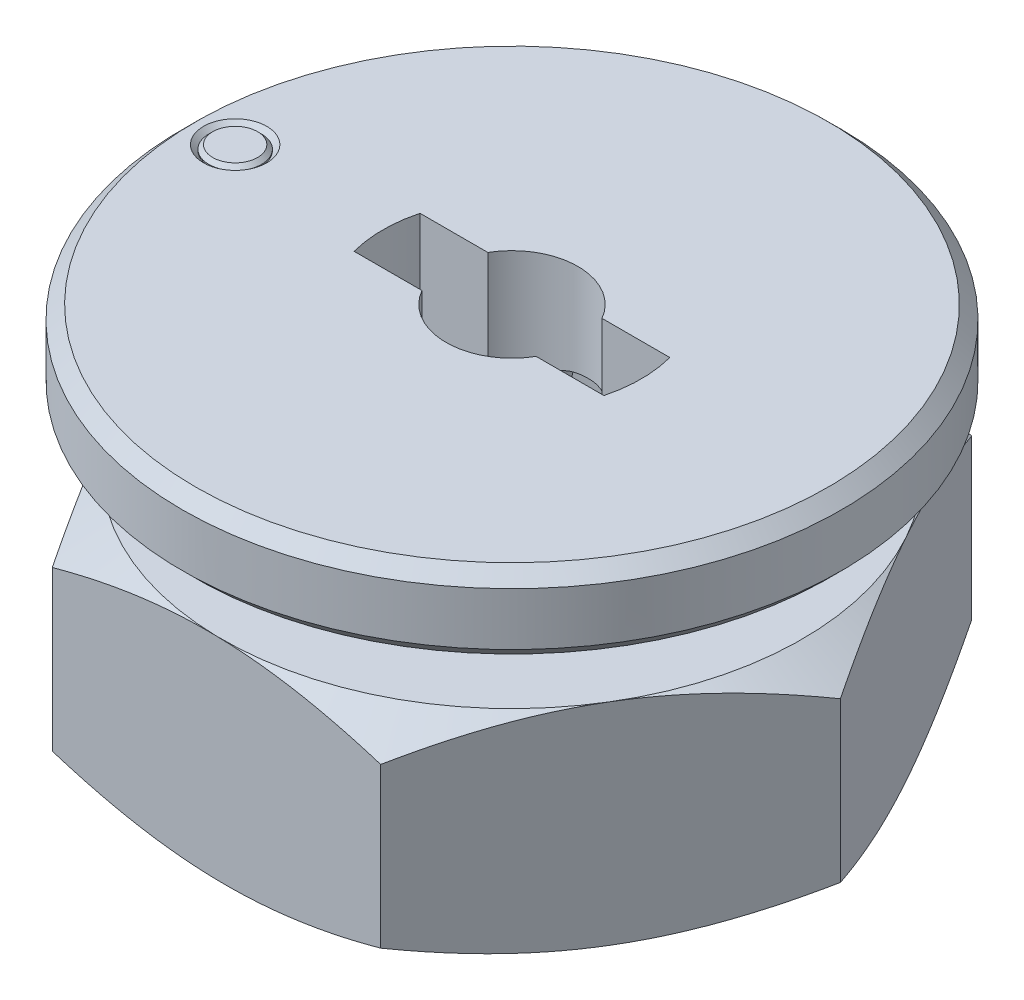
ISO-10303-21;
HEADER;
FILE_DESCRIPTION(('STEP AP214'),'2;1');
FILE_NAME('part.step','',(''),(''),'','','');
FILE_SCHEMA(('AUTOMOTIVE_DESIGN { 1 0 10303 214 1 1 1 1 }'));
ENDSEC;
DATA;
#1=APPLICATION_CONTEXT('core data for automotive mechanical design processes');
#2=APPLICATION_PROTOCOL_DEFINITION('international standard','automotive_design',2000,#1);
#3=PRODUCT_CONTEXT('',#1,'mechanical');
#4=PRODUCT('Part','Part','',(#3));
#5=PRODUCT_RELATED_PRODUCT_CATEGORY('part','',(#4));
#6=PRODUCT_DEFINITION_FORMATION('','',#4);
#7=PRODUCT_DEFINITION_CONTEXT('part definition',#1,'design');
#8=PRODUCT_DEFINITION('design','',#6,#7);
#9=PRODUCT_DEFINITION_SHAPE('','',#8);
#10=(LENGTH_UNIT() NAMED_UNIT(*) SI_UNIT(.MILLI.,.METRE.));
#11=(NAMED_UNIT(*) PLANE_ANGLE_UNIT() SI_UNIT($,.RADIAN.));
#12=(NAMED_UNIT(*) SI_UNIT($,.STERADIAN.) SOLID_ANGLE_UNIT());
#13=UNCERTAINTY_MEASURE_WITH_UNIT(LENGTH_MEASURE(1.E-05),#10,'distance_accuracy_value','');
#14=(GEOMETRIC_REPRESENTATION_CONTEXT(3) GLOBAL_UNCERTAINTY_ASSIGNED_CONTEXT((#13)) GLOBAL_UNIT_ASSIGNED_CONTEXT((#10,
#11,#12)) REPRESENTATION_CONTEXT('',''));
#15=CARTESIAN_POINT('',(0.,0.,0.));
#16=DIRECTION('',(0.,0.,1.));
#17=DIRECTION('',(1.,0.,0.));
#18=AXIS2_PLACEMENT_3D('',#15,#16,#17);
#19=CARTESIAN_POINT('',(-6.55976256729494,10.5,10.8767112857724));
#20=DIRECTION('',(0.0190970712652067,0.,-0.999817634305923));
#21=DIRECTION('',(-0.999817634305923,0.,-0.0190970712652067));
#22=AXIS2_PLACEMENT_3D('',#19,#20,#21);
#23=PLANE('',#22);
#24=DIRECTION('',(0.,-1.,0.));
#25=VECTOR('',#24,1.);
#26=CARTESIAN_POINT('',(-6.55976256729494,10.5,10.8767112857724));
#27=LINE('',#26,#25);
#28=CARTESIAN_POINT('',(-6.55976256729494,9.51751962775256,10.8767112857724));
#29=VERTEX_POINT('',#28);
#30=CARTESIAN_POINT('',(-6.55976256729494,3.48248037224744,10.8767112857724));
#31=VERTEX_POINT('',#30);
#32=EDGE_CURVE('P0_E251',#29,#31,#27,.T.);
#33=ORIENTED_EDGE('',*,*,#32,.T.);
#34=CARTESIAN_POINT('',(-17.3317899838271,7.90017993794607,10.6709595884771));
#35=CARTESIAN_POINT('',(-17.0913494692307,7.78336250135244,10.6755521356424));
#36=CARTESIAN_POINT('',(-16.8506285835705,7.6671226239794,10.6801500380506));
#37=CARTESIAN_POINT('',(-16.3685675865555,7.43592866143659,10.689357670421));
#38=CARTESIAN_POINT('',(-16.1272274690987,7.32097458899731,10.6939674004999));
#39=CARTESIAN_POINT('',(-15.4021271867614,6.9782072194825,10.7078172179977));
#40=CARTESIAN_POINT('',(-14.9173571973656,6.75252292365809,10.7170765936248));
#41=CARTESIAN_POINT('',(-13.9419882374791,6.30698279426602,10.7357066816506));
#42=CARTESIAN_POINT('',(-13.4513719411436,6.0871648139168,10.7450777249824));
#43=CARTESIAN_POINT('',(-12.4662607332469,5.65643326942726,10.7638938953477));
#44=CARTESIAN_POINT('',(-11.971766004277,5.4455192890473,10.7733390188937));
#45=CARTESIAN_POINT('',(-10.9618752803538,5.02824105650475,10.7926284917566));
#46=CARTESIAN_POINT('',(-10.4463241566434,4.82225044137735,10.8024758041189));
#47=CARTESIAN_POINT('',(-9.40921090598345,4.42570010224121,10.8222852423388));
#48=CARTESIAN_POINT('',(-8.88764811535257,4.23514210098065,10.8322473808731));
#49=CARTESIAN_POINT('',(-7.83865389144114,3.87441451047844,10.8522837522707));
#50=CARTESIAN_POINT('',(-7.31123656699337,3.70420420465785,10.8623577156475));
#51=CARTESIAN_POINT('',(-6.24878655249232,3.38958057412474,10.8826511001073));
#52=CARTESIAN_POINT('',(-5.71375629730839,3.24515919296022,10.8928704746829));
#53=CARTESIAN_POINT('',(-4.90689179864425,3.05345965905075,10.908282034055));
#54=CARTESIAN_POINT('',(-4.63796976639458,2.99384653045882,10.9134185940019));
#55=CARTESIAN_POINT('',(-4.09827602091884,2.88363407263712,10.9237270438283));
#56=CARTESIAN_POINT('',(-3.82750434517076,2.8330345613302,10.9288989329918));
#57=CARTESIAN_POINT('',(-3.28429311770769,2.74173840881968,10.9392745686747));
#58=CARTESIAN_POINT('',(-3.01185359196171,2.70104161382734,10.9444783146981));
#59=CARTESIAN_POINT('',(-2.46559007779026,2.63036025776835,10.9549122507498));
#60=CARTESIAN_POINT('',(-2.19176614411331,2.60037527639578,10.9601424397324));
#61=CARTESIAN_POINT('',(-1.64671999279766,2.55209284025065,10.9705531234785));
#62=CARTESIAN_POINT('',(-1.37551103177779,2.53364659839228,10.9757333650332));
#63=CARTESIAN_POINT('',(-0.83255652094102,2.50824544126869,10.9861040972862));
#64=CARTESIAN_POINT('',(-0.560810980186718,2.50129033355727,10.9912945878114));
#65=CARTESIAN_POINT('',(-0.0172689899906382,2.49903711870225,11.0016765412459));
#66=CARTESIAN_POINT('',(0.254527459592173,2.50373904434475,11.006868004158));
#67=CARTESIAN_POINT('',(0.797678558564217,2.52468439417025,11.0172424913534));
#68=CARTESIAN_POINT('',(1.06903318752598,2.54092833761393,11.0224255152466));
#69=CARTESIAN_POINT('',(1.71920917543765,2.59333097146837,11.0348442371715));
#70=CARTESIAN_POINT('',(2.09760590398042,2.63485618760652,11.042071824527));
#71=CARTESIAN_POINT('',(2.85163635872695,2.73810469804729,11.056474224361));
#72=CARTESIAN_POINT('',(3.22726970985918,2.79983068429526,11.0636490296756));
#73=CARTESIAN_POINT('',(3.97540010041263,2.94128503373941,11.0779387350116));
#74=CARTESIAN_POINT('',(4.34789449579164,3.021027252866,11.0850535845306));
#75=CARTESIAN_POINT('',(5.08916888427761,3.19607687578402,11.0992123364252));
#76=CARTESIAN_POINT('',(5.4579489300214,3.29138405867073,11.1062562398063));
#77=CARTESIAN_POINT('',(6.19993218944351,3.49750071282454,11.1204285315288));
#78=CARTESIAN_POINT('',(6.57305246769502,3.6086067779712,11.1275553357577));
#79=CARTESIAN_POINT('',(7.31561834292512,3.84242782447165,11.1417387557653));
#80=CARTESIAN_POINT('',(7.68506391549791,3.96514288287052,11.1487953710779));
#81=CARTESIAN_POINT('',(8.42046057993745,4.22022219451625,11.1628418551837));
#82=CARTESIAN_POINT('',(8.7864127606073,4.35258332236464,11.1698317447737));
#83=CARTESIAN_POINT('',(9.51527629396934,4.62538494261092,11.183753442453));
#84=CARTESIAN_POINT('',(9.8781876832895,4.76582533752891,11.1906852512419));
#85=CARTESIAN_POINT('',(10.7382919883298,5.10793141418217,11.20711372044));
#86=CARTESIAN_POINT('',(11.2342745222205,5.31263679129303,11.2165872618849));
#87=CARTESIAN_POINT('',(12.2219755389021,5.73212161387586,11.2354528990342));
#88=CARTESIAN_POINT('',(12.713693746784,5.94690170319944,11.2448449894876));
#89=CARTESIAN_POINT('',(13.693665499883,6.3845070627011,11.2635629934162));
#90=CARTESIAN_POINT('',(14.1819182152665,6.60733418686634,11.2728888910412));
#91=CARTESIAN_POINT('',(15.1554266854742,7.05940005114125,11.2914834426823));
#92=CARTESIAN_POINT('',(15.6406825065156,7.28863864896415,11.3007520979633));
#93=CARTESIAN_POINT('',(16.6092412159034,7.75258231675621,11.3192521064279));
#94=CARTESIAN_POINT('',(17.0925412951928,7.98729324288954,11.328483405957));
#95=CARTESIAN_POINT('',(18.0570407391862,8.46099321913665,11.3469058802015));
#96=CARTESIAN_POINT('',(18.5382400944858,8.69998228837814,11.3560970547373));
#97=CARTESIAN_POINT('',(19.4987984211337,9.18146905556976,11.374444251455));
#98=CARTESIAN_POINT('',(19.9781576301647,9.42396627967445,11.3836002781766));
#99=CARTESIAN_POINT('',(20.9353670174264,9.91192366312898,11.4018835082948));
#100=CARTESIAN_POINT('',(21.4132171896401,10.1573838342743,11.4110107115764));
#101=CARTESIAN_POINT('',(22.763932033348,10.8556670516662,11.4368101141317));
#102=CARTESIAN_POINT('',(23.6352863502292,11.3114126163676,11.4534534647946));
#103=CARTESIAN_POINT('',(25.3747476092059,12.2291235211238,11.4866781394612));
#104=CARTESIAN_POINT('',(26.2428544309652,12.6910890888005,11.5032594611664));
#105=CARTESIAN_POINT('',(27.9743079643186,13.6185924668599,11.5363311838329));
#106=CARTESIAN_POINT('',(28.8376611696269,14.084118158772,11.5528217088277));
#107=CARTESIAN_POINT('',(30.1311610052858,14.7851694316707,11.5775282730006));
#108=CARTESIAN_POINT('',(30.5620606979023,15.0193071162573,11.5857586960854));
#109=CARTESIAN_POINT('',(31.4234081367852,15.4884111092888,11.6022109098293));
#110=CARTESIAN_POINT('',(31.8538558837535,15.7233774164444,11.6104327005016));
#111=CARTESIAN_POINT('',(32.284103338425,15.9587101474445,11.6186506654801));
#112=B_SPLINE_CURVE_WITH_KNOTS('',3,(#34,#35,#36,#37,#38,#39,#40,#41,#42,#43,#44,#45,#46,#47,
#48,#49,#50,#51,#52,#53,#54,#55,#56,#57,#58,#59,#60,#61,#62,#63,#64,#65,#66,#67,#68,#69,#70,#71,
#72,#73,#74,#75,#76,#77,#78,#79,#80,#81,#82,#83,#84,#85,#86,#87,#88,#89,#90,#91,#92,#93,#94,#95,
#96,#97,#98,#99,#100,#101,#102,#103,#104,#105,#106,#107,#108,#109,#110,#111),.UNSPECIFIED.,.F.,
.F.,(4,2,2,2,2,2,2,2,2,2,2,2,2,2,2,2,2,2,2,2,2,2,2,2,2,2,2,2,2,2,2,2,2,2,2,2,2,2,4),(0.,
0.80206553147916,1.60413899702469,3.20851989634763,4.82152532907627,6.43445527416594,
8.10006932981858,9.76586906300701,11.4282775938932,13.0901658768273,13.9165333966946,
14.742884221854,15.5692222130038,16.395527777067,17.2109461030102,18.0263507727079,
18.841757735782,19.6572013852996,20.7987821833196,21.9405151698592,23.0831292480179,
24.2257271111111,25.3936312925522,26.5615432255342,27.7290784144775,28.8965995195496,
30.5063964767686,32.1162964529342,33.7265697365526,35.3368073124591,36.9488552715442,
38.560910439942,40.1727498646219,41.7845957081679,44.7350074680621,47.685527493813,
50.6285210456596,52.099936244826,53.5713491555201),.UNSPECIFIED.);
#113=CARTESIAN_POINT('',(-0.210067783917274,2.5,10.9979939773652));
#114=VERTEX_POINT('',#113);
#115=EDGE_CURVE('P0_E34',#31,#114,#112,.T.);
#116=ORIENTED_EDGE('',*,*,#115,.T.);
#117=CARTESIAN_POINT('',(6.13962699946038,3.48248037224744,11.1192766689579));
#118=VERTEX_POINT('',#117);
#119=EDGE_CURVE('P0_E322',#114,#118,#112,.T.);
#120=ORIENTED_EDGE('',*,*,#119,.T.);
#121=DIRECTION('',(0.,-1.,0.));
#122=VECTOR('',#121,1.);
#123=CARTESIAN_POINT('',(6.13962699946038,10.5,11.1192766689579));
#124=LINE('',#123,#122);
#125=CARTESIAN_POINT('',(6.13962699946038,9.51751962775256,11.1192766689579));
#126=VERTEX_POINT('',#125);
#127=EDGE_CURVE('P0_E230',#126,#118,#124,.T.);
#128=ORIENTED_EDGE('',*,*,#127,.F.);
#129=CARTESIAN_POINT('',(-17.3317899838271,5.09982006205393,10.6709595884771));
#130=CARTESIAN_POINT('',(-17.0913494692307,5.21663749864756,10.6755521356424));
#131=CARTESIAN_POINT('',(-16.8506285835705,5.3328773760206,10.6801500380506));
#132=CARTESIAN_POINT('',(-16.3685675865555,5.56407133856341,10.689357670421));
#133=CARTESIAN_POINT('',(-16.1272274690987,5.67902541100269,10.6939674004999));
#134=CARTESIAN_POINT('',(-15.4021271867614,6.0217927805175,10.7078172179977));
#135=CARTESIAN_POINT('',(-14.9173571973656,6.24747707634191,10.7170765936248));
#136=CARTESIAN_POINT('',(-13.9419882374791,6.69301720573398,10.7357066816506));
#137=CARTESIAN_POINT('',(-13.4513719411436,6.9128351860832,10.7450777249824));
#138=CARTESIAN_POINT('',(-12.4662607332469,7.34356673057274,10.7638938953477));
#139=CARTESIAN_POINT('',(-11.971766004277,7.5544807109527,10.7733390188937));
#140=CARTESIAN_POINT('',(-10.9618752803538,7.97175894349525,10.7926284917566));
#141=CARTESIAN_POINT('',(-10.4463241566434,8.17774955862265,10.8024758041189));
#142=CARTESIAN_POINT('',(-9.40921090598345,8.57429989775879,10.8222852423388));
#143=CARTESIAN_POINT('',(-8.88764811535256,8.76485789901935,10.8322473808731));
#144=CARTESIAN_POINT('',(-7.83865389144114,9.12558548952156,10.8522837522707));
#145=CARTESIAN_POINT('',(-7.31123656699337,9.29579579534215,10.8623577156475));
#146=CARTESIAN_POINT('',(-6.24878655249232,9.61041942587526,10.8826511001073));
#147=CARTESIAN_POINT('',(-5.71375629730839,9.75484080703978,10.8928704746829));
#148=CARTESIAN_POINT('',(-4.90689179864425,9.94654034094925,10.908282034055));
#149=CARTESIAN_POINT('',(-4.63796976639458,10.0061534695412,10.9134185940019));
#150=CARTESIAN_POINT('',(-4.09827602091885,10.1163659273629,10.9237270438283));
#151=CARTESIAN_POINT('',(-3.82750434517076,10.1669654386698,10.9288989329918));
#152=CARTESIAN_POINT('',(-3.28429311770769,10.2582615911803,10.9392745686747));
#153=CARTESIAN_POINT('',(-3.01185359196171,10.2989583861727,10.9444783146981));
#154=CARTESIAN_POINT('',(-2.46559007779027,10.3696397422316,10.9549122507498));
#155=CARTESIAN_POINT('',(-2.19176614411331,10.3996247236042,10.9601424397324));
#156=CARTESIAN_POINT('',(-1.64671999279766,10.4479071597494,10.9705531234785));
#157=CARTESIAN_POINT('',(-1.3755110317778,10.4663534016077,10.9757333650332));
#158=CARTESIAN_POINT('',(-0.832556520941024,10.4917545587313,10.9861040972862));
#159=CARTESIAN_POINT('',(-0.560810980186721,10.4987096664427,10.9912945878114));
#160=CARTESIAN_POINT('',(-0.0172689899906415,10.5009628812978,11.0016765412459));
#161=CARTESIAN_POINT('',(0.25452745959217,10.4962609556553,11.006868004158));
#162=CARTESIAN_POINT('',(0.797678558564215,10.4753156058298,11.0172424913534));
#163=CARTESIAN_POINT('',(1.06903318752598,10.4590716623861,11.0224255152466));
#164=CARTESIAN_POINT('',(1.71920917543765,10.4066690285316,11.0348442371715));
#165=CARTESIAN_POINT('',(2.09760590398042,10.3651438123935,11.042071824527));
#166=CARTESIAN_POINT('',(2.85163635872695,10.2618953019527,11.056474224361));
#167=CARTESIAN_POINT('',(3.22726970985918,10.2001693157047,11.0636490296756));
#168=CARTESIAN_POINT('',(3.97540010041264,10.0587149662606,11.0779387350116));
#169=CARTESIAN_POINT('',(4.34789449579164,9.978972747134,11.0850535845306));
#170=CARTESIAN_POINT('',(5.08916888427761,9.80392312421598,11.0992123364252));
#171=CARTESIAN_POINT('',(5.4579489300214,9.70861594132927,11.1062562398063));
#172=CARTESIAN_POINT('',(6.19993218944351,9.50249928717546,11.1204285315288));
#173=CARTESIAN_POINT('',(6.57305246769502,9.3913932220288,11.1275553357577));
#174=CARTESIAN_POINT('',(7.31561834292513,9.15757217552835,11.1417387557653));
#175=CARTESIAN_POINT('',(7.68506391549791,9.03485711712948,11.1487953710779));
#176=CARTESIAN_POINT('',(8.42046057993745,8.77977780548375,11.1628418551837));
#177=CARTESIAN_POINT('',(8.78641276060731,8.64741667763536,11.1698317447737));
#178=CARTESIAN_POINT('',(9.51527629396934,8.37461505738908,11.183753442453));
#179=CARTESIAN_POINT('',(9.87818768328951,8.23417466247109,11.1906852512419));
#180=CARTESIAN_POINT('',(10.7382919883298,7.89206858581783,11.20711372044));
#181=CARTESIAN_POINT('',(11.2342745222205,7.68736320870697,11.2165872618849));
#182=CARTESIAN_POINT('',(12.2219755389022,7.26787838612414,11.2354528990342));
#183=CARTESIAN_POINT('',(12.713693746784,7.05309829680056,11.2448449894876));
#184=CARTESIAN_POINT('',(13.693665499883,6.61549293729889,11.2635629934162));
#185=CARTESIAN_POINT('',(14.1819182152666,6.39266581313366,11.2728888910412));
#186=CARTESIAN_POINT('',(15.1554266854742,5.94059994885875,11.2914834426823));
#187=CARTESIAN_POINT('',(15.6406825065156,5.71136135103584,11.3007520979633));
#188=CARTESIAN_POINT('',(16.6092412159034,5.24741768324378,11.3192521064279));
#189=CARTESIAN_POINT('',(17.0925412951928,5.01270675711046,11.328483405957));
#190=CARTESIAN_POINT('',(18.0570407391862,4.53900678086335,11.3469058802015));
#191=CARTESIAN_POINT('',(18.5382400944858,4.30001771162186,11.3560970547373));
#192=CARTESIAN_POINT('',(19.4987984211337,3.81853094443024,11.374444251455));
#193=CARTESIAN_POINT('',(19.9781576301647,3.57603372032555,11.3836002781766));
#194=CARTESIAN_POINT('',(20.9353670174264,3.08807633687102,11.4018835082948));
#195=CARTESIAN_POINT('',(21.4132171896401,2.84261616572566,11.4110107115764));
#196=CARTESIAN_POINT('',(22.763932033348,2.14433294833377,11.4368101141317));
#197=CARTESIAN_POINT('',(23.6352863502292,1.68858738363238,11.4534534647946));
#198=CARTESIAN_POINT('',(25.3747476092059,0.770876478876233,11.4866781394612));
#199=CARTESIAN_POINT('',(26.2428544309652,0.30891091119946,11.5032594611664));
#200=CARTESIAN_POINT('',(27.9743079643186,-0.61859246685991,11.5363311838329));
#201=CARTESIAN_POINT('',(28.8376611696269,-1.08411815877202,11.5528217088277));
#202=CARTESIAN_POINT('',(30.1311610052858,-1.78516943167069,11.5775282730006));
#203=CARTESIAN_POINT('',(30.5620606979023,-2.01930711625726,11.5857586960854));
#204=CARTESIAN_POINT('',(31.4234081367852,-2.48841110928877,11.6022109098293));
#205=CARTESIAN_POINT('',(31.8538558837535,-2.72337741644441,11.6104327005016));
#206=CARTESIAN_POINT('',(32.284103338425,-2.95871014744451,11.6186506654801));
#207=B_SPLINE_CURVE_WITH_KNOTS('',3,(#129,#130,#131,#132,#133,#134,#135,#136,#137,#138,#139,
#140,#141,#142,#143,#144,#145,#146,#147,#148,#149,#150,#151,#152,#153,#154,#155,#156,#157,#158,
#159,#160,#161,#162,#163,#164,#165,#166,#167,#168,#169,#170,#171,#172,#173,#174,#175,#176,#177,
#178,#179,#180,#181,#182,#183,#184,#185,#186,#187,#188,#189,#190,#191,#192,#193,#194,#195,#196,
#197,#198,#199,#200,#201,#202,#203,#204,#205,#206),.UNSPECIFIED.,.F.,.F.,(4,2,2,2,2,2,2,2,2,2,2,
2,2,2,2,2,2,2,2,2,2,2,2,2,2,2,2,2,2,2,2,2,2,2,2,2,2,2,4),(0.,0.802065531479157,1.60413899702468,
3.20851989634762,4.82152532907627,6.43445527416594,8.10006932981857,9.76586906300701,
11.4282775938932,13.0901658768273,13.9165333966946,14.742884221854,15.5692222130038,
16.395527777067,17.2109461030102,18.0263507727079,18.841757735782,19.6572013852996,
20.7987821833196,21.9405151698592,23.0831292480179,24.2257271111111,25.3936312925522,
26.5615432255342,27.7290784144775,28.8965995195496,30.5063964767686,32.1162964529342,
33.7265697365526,35.3368073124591,36.9488552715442,38.560910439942,40.1727498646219,
41.7845957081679,44.7350074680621,47.685527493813,50.6285210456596,52.099936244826,
53.5713491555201),.UNSPECIFIED.);
#208=CARTESIAN_POINT('',(-0.210067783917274,10.5,10.9979939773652));
#209=VERTEX_POINT('',#208);
#210=EDGE_CURVE('P0_E221',#126,#209,#207,.F.);
#211=ORIENTED_EDGE('',*,*,#210,.T.);
#212=EDGE_CURVE('P0_E181',#209,#29,#207,.F.);
#213=ORIENTED_EDGE('',*,*,#212,.T.);
#214=EDGE_LOOP('',(#33,#116,#120,#128,#211,#213));
#215=FACE_BOUND('',#214,.T.);
#216=ADVANCED_FACE('P0_F16',(#215),#23,.F.);
#217=CARTESIAN_POINT('',(6.13962699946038,10.5,11.1192766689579));
#218=DIRECTION('',(-0.856318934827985,0.,-0.516447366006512));
#219=DIRECTION('',(-0.516447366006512,0.,0.856318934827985));
#220=AXIS2_PLACEMENT_3D('',#217,#218,#219);
#221=PLANE('',#220);
#222=ORIENTED_EDGE('',*,*,#127,.T.);
#223=CARTESIAN_POINT('',(6.13950773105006,3.48254703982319,11.1194744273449));
#224=CARTESIAN_POINT('',(6.28370549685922,3.40195915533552,10.8803807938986));
#225=CARTESIAN_POINT('',(6.42844090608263,3.32502892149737,10.6403956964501));
#226=CARTESIAN_POINT('',(6.7190723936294,3.17949864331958,10.1585010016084));
#227=CARTESIAN_POINT('',(6.86496883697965,3.11090133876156,9.91659079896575));
#228=CARTESIAN_POINT('',(7.30500899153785,2.91893635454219,9.18696230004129));
#229=CARTESIAN_POINT('',(7.60088981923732,2.80974772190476,8.69636369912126));
#230=CARTESIAN_POINT('',(8.0436619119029,2.68171411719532,7.96220538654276));
#231=CARTESIAN_POINT('',(8.18923038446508,2.64524220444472,7.72083899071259));
#232=CARTESIAN_POINT('',(8.4810413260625,2.58408130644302,7.23698864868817));
#233=CARTESIAN_POINT('',(8.62728380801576,2.55939254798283,6.99450468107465));
#234=CARTESIAN_POINT('',(8.92001258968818,2.52243034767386,6.50913247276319));
#235=CARTESIAN_POINT('',(9.06649839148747,2.51014215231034,6.26624505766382));
#236=CARTESIAN_POINT('',(9.3596057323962,2.49824292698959,5.78024516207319));
#237=CARTESIAN_POINT('',(9.50622726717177,2.49863150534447,5.53713268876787));
#238=CARTESIAN_POINT('',(9.78033707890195,2.51120116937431,5.08263250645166));
#239=CARTESIAN_POINT('',(9.90784490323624,2.52184903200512,4.87121238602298));
#240=CARTESIAN_POINT('',(10.1625672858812,2.5525316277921,4.44885840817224));
#241=CARTESIAN_POINT('',(10.2897818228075,2.57256702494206,4.23792458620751));
#242=CARTESIAN_POINT('',(10.5438484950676,2.62167538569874,3.81665783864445));
#243=CARTESIAN_POINT('',(10.6707002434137,2.65075581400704,3.60632555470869));
#244=CARTESIAN_POINT('',(10.9238090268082,2.7174439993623,3.18664707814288));
#245=CARTESIAN_POINT('',(11.0500660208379,2.7550523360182,2.97730095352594));
#246=CARTESIAN_POINT('',(11.4333262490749,2.88161991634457,2.34181898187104));
#247=CARTESIAN_POINT('',(11.689219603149,2.98319945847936,1.91752342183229));
#248=CARTESIAN_POINT('',(12.1971905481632,3.21374369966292,1.07525920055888));
#249=CARTESIAN_POINT('',(12.4492746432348,3.34265425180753,0.657279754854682));
#250=CARTESIAN_POINT('',(12.6995088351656,3.48254703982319,0.242367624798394));
#251=B_SPLINE_CURVE_WITH_KNOTS('',3,(#223,#224,#225,#226,#227,#228,#229,#230,#231,#232,#233,
#234,#235,#236,#237,#238,#239,#240,#241,#242,#243,#244,#245,#246,#247,#248,#249,#250),
.UNSPECIFIED.,.F.,.F.,(4,2,2,2,2,2,2,2,2,2,2,2,2,4),(0.,0.871755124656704,1.74379610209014,
3.49159027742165,4.34403665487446,5.19649943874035,6.04794680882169,6.89936787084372,
7.64056020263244,8.38180496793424,9.1236630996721,9.86557166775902,11.3820155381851,
12.8954827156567),.UNSPECIFIED.);
#252=CARTESIAN_POINT('',(9.41950828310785,2.5,5.68092102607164));
#253=VERTEX_POINT('',#252);
#254=EDGE_CURVE('P0_E321',#118,#253,#251,.T.);
#255=ORIENTED_EDGE('',*,*,#254,.T.);
#256=CARTESIAN_POINT('',(12.6993895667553,3.48248037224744,0.24256538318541));
#257=VERTEX_POINT('',#256);
#258=EDGE_CURVE('P0_E315',#253,#257,#251,.T.);
#259=ORIENTED_EDGE('',*,*,#258,.T.);
#260=DIRECTION('',(0.,-1.,0.));
#261=VECTOR('',#260,1.);
#262=CARTESIAN_POINT('',(12.6993895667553,10.5,0.24256538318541));
#263=LINE('',#262,#261);
#264=CARTESIAN_POINT('',(12.6993895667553,9.51751962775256,0.24256538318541));
#265=VERTEX_POINT('',#264);
#266=EDGE_CURVE('P0_E263',#265,#257,#263,.T.);
#267=ORIENTED_EDGE('',*,*,#266,.F.);
#268=CARTESIAN_POINT('',(12.6995088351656,9.51745296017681,0.242367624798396));
#269=CARTESIAN_POINT('',(12.5553110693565,9.59804084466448,0.481461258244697));
#270=CARTESIAN_POINT('',(12.4105756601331,9.67497107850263,0.721446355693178));
#271=CARTESIAN_POINT('',(12.1199441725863,9.82050135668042,1.2033410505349));
#272=CARTESIAN_POINT('',(11.974047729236,9.88909866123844,1.44525125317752));
#273=CARTESIAN_POINT('',(11.5340075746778,10.0810636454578,2.17487975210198));
#274=CARTESIAN_POINT('',(11.2381267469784,10.1902522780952,2.66547835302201));
#275=CARTESIAN_POINT('',(10.7953546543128,10.3182858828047,3.39963666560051));
#276=CARTESIAN_POINT('',(10.6497861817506,10.3547577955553,3.64100306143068));
#277=CARTESIAN_POINT('',(10.3579752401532,10.415918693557,4.1248534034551));
#278=CARTESIAN_POINT('',(10.2117327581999,10.4406074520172,4.36733737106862));
#279=CARTESIAN_POINT('',(9.91900397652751,10.4775696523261,4.85270957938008));
#280=CARTESIAN_POINT('',(9.77251817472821,10.4898578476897,5.09559699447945));
#281=CARTESIAN_POINT('',(9.47941083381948,10.5017570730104,5.58159689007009));
#282=CARTESIAN_POINT('',(9.33278929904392,10.5013684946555,5.8247093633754));
#283=CARTESIAN_POINT('',(9.05867948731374,10.4887988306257,6.27920954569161));
#284=CARTESIAN_POINT('',(8.93117166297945,10.4781509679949,6.4906296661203));
#285=CARTESIAN_POINT('',(8.67644928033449,10.4474683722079,6.91298364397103));
#286=CARTESIAN_POINT('',(8.54923474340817,10.4274329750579,7.12391746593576));
#287=CARTESIAN_POINT('',(8.29516807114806,10.3783246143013,7.54518421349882));
#288=CARTESIAN_POINT('',(8.16831632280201,10.349244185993,7.75551649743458));
#289=CARTESIAN_POINT('',(7.91520753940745,10.2825560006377,8.17519497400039));
#290=CARTESIAN_POINT('',(7.78895054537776,10.2449476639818,8.38454109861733));
#291=CARTESIAN_POINT('',(7.4056903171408,10.1183800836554,9.02002307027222));
#292=CARTESIAN_POINT('',(7.14979696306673,10.0168005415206,9.44431863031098));
#293=CARTESIAN_POINT('',(6.64182601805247,9.78625630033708,10.2865828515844));
#294=CARTESIAN_POINT('',(6.38974192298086,9.65734574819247,10.7045622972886));
#295=CARTESIAN_POINT('',(6.13950773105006,9.51745296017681,11.1194744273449));
#296=B_SPLINE_CURVE_WITH_KNOTS('',3,(#268,#269,#270,#271,#272,#273,#274,#275,#276,#277,#278,
#279,#280,#281,#282,#283,#284,#285,#286,#287,#288,#289,#290,#291,#292,#293,#294,#295),
.UNSPECIFIED.,.F.,.F.,(4,2,2,2,2,2,2,2,2,2,2,2,2,4),(0.,0.871755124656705,1.74379610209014,
3.49159027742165,4.34403665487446,5.19649943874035,6.04794680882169,6.89936787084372,
7.64056020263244,8.38180496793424,9.1236630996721,9.86557166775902,11.3820155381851,
12.8954827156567),.UNSPECIFIED.);
#297=CARTESIAN_POINT('',(9.41950828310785,10.5,5.68092102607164));
#298=VERTEX_POINT('',#297);
#299=EDGE_CURVE('P0_E244',#265,#298,#296,.T.);
#300=ORIENTED_EDGE('',*,*,#299,.T.);
#301=EDGE_CURVE('P0_E178',#298,#126,#296,.T.);
#302=ORIENTED_EDGE('',*,*,#301,.T.);
#303=EDGE_LOOP('',(#222,#255,#259,#267,#300,#302));
#304=FACE_BOUND('',#303,.T.);
#305=ADVANCED_FACE('P0_F241',(#304),#221,.F.);
#306=CARTESIAN_POINT('',(12.6993895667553,10.5,0.24256538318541));
#307=DIRECTION('',(-0.875416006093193,0.,0.48337026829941));
#308=DIRECTION('',(0.48337026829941,0.,0.875416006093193));
#309=AXIS2_PLACEMENT_3D('',#306,#307,#308);
#310=PLANE('',#309);
#311=ORIENTED_EDGE('',*,*,#266,.T.);
#312=CARTESIAN_POINT('',(12.6995011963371,3.48254703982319,0.242767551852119));
#313=CARTESIAN_POINT('',(12.5645389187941,3.40195915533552,-0.00165819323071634));
#314=CARTESIAN_POINT('',(12.4290734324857,3.32502892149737,-0.246995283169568));
#315=CARTESIAN_POINT('',(12.1570561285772,3.17949864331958,-0.739636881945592));
#316=CARTESIAN_POINT('',(12.0205039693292,3.11090133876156,-0.98694200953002));
#317=CARTESIAN_POINT('',(11.6086472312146,2.91893635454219,-1.73284221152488));
#318=CARTESIAN_POINT('',(11.3317167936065,2.80974772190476,-2.2343818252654));
#319=CARTESIAN_POINT('',(10.9173030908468,2.68171411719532,-2.98491286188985));
#320=CARTESIAN_POINT('',(10.781057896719,2.64524220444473,-3.23166205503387));
#321=CARTESIAN_POINT('',(10.5079366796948,2.58408130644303,-3.72630291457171));
#322=CARTESIAN_POINT('',(10.3710606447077,2.55939254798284,-3.97419460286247));
#323=CARTESIAN_POINT('',(10.0970803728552,2.52243034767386,-4.47039126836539));
#324=CARTESIAN_POINT('',(9.95997660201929,2.51014215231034,-4.718695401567));
#325=CARTESIAN_POINT('',(9.68564201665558,2.4982429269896,-5.21553375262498));
#326=CARTESIAN_POINT('',(9.5484112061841,2.49863150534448,-5.46406796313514));
#327=CARTESIAN_POINT('',(9.29185740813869,2.51120116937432,-5.92870411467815));
#328=CARTESIAN_POINT('',(9.17251612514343,2.52184903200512,-6.14483918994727));
#329=CARTESIAN_POINT('',(8.93410804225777,2.5525316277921,-6.57661223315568));
#330=CARTESIAN_POINT('',(8.81504126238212,2.57256702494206,-6.7922501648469));
#331=CARTESIAN_POINT('',(8.57724689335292,2.62167538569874,-7.22291173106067));
#332=CARTESIAN_POINT('',(8.45851966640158,2.65075581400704,-7.4379347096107));
#333=CARTESIAN_POINT('',(8.22162183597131,2.7174439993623,-7.86697258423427));
#334=CARTESIAN_POINT('',(8.10345127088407,2.75505233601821,-8.08098741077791));
#335=CARTESIAN_POINT('',(7.74473785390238,2.88161991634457,-8.73064149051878));
#336=CARTESIAN_POINT('',(7.50523379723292,2.98319945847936,-9.16439941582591));
#337=CARTESIAN_POINT('',(7.02979705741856,3.21374369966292,-10.0254472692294));
#338=CARTESIAN_POINT('',(6.79385828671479,3.34265425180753,-10.4527482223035));
#339=CARTESIAN_POINT('',(6.55965093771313,3.48254703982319,-10.8769134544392));
#340=B_SPLINE_CURVE_WITH_KNOTS('',3,(#312,#313,#314,#315,#316,#317,#318,#319,#320,#321,#322,
#323,#324,#325,#326,#327,#328,#329,#330,#331,#332,#333,#334,#335,#336,#337,#338,#339),
.UNSPECIFIED.,.F.,.F.,(4,2,2,2,2,2,2,2,2,2,2,2,2,4),(0.,0.871755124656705,1.74379610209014,
3.49159027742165,4.34403665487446,5.19649943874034,6.04794680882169,6.89936787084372,
7.64056020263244,8.38180496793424,9.1236630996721,9.86557166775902,11.3820155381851,
12.8954827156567),.UNSPECIFIED.);
#341=CARTESIAN_POINT('',(9.62957606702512,2.5,-5.31707295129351));
#342=VERTEX_POINT('',#341);
#343=EDGE_CURVE('P0_E139',#257,#342,#340,.T.);
#344=ORIENTED_EDGE('',*,*,#343,.T.);
#345=CARTESIAN_POINT('',(6.55976256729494,3.48248037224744,-10.8767112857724));
#346=VERTEX_POINT('',#345);
#347=EDGE_CURVE('P0_E122',#342,#346,#340,.T.);
#348=ORIENTED_EDGE('',*,*,#347,.T.);
#349=DIRECTION('',(0.,-1.,0.));
#350=VECTOR('',#349,1.);
#351=CARTESIAN_POINT('',(6.55976256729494,10.5,-10.8767112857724));
#352=LINE('',#351,#350);
#353=CARTESIAN_POINT('',(6.55976256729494,9.51751962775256,-10.8767112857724));
#354=VERTEX_POINT('',#353);
#355=EDGE_CURVE('P0_E138',#354,#346,#352,.T.);
#356=ORIENTED_EDGE('',*,*,#355,.F.);
#357=CARTESIAN_POINT('',(6.55965093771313,9.51745296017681,-10.8769134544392));
#358=CARTESIAN_POINT('',(6.69461321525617,9.59804084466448,-10.6324877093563));
#359=CARTESIAN_POINT('',(6.83007870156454,9.67497107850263,-10.3871506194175));
#360=CARTESIAN_POINT('',(7.10209600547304,9.82050135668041,-9.89450902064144));
#361=CARTESIAN_POINT('',(7.23864816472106,9.88909866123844,-9.64720389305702));
#362=CARTESIAN_POINT('',(7.65050490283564,10.0810636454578,-8.90130369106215));
#363=CARTESIAN_POINT('',(7.92743534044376,10.1902522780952,-8.39976407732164));
#364=CARTESIAN_POINT('',(8.34184904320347,10.3182858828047,-7.64923304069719));
#365=CARTESIAN_POINT('',(8.4780942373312,10.3547577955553,-7.40248384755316));
#366=CARTESIAN_POINT('',(8.75121545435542,10.415918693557,-6.90784298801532));
#367=CARTESIAN_POINT('',(8.88809148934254,10.4406074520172,-6.65995129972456));
#368=CARTESIAN_POINT('',(9.16207176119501,10.4775696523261,-6.16375463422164));
#369=CARTESIAN_POINT('',(9.29917553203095,10.4898578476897,-5.91545050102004));
#370=CARTESIAN_POINT('',(9.57351011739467,10.5017570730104,-5.41861214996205));
#371=CARTESIAN_POINT('',(9.71074092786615,10.5013684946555,-5.17007793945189));
#372=CARTESIAN_POINT('',(9.96729472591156,10.4887988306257,-4.70544178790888));
#373=CARTESIAN_POINT('',(10.0866360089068,10.4781509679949,-4.48930671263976));
#374=CARTESIAN_POINT('',(10.3250440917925,10.4474683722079,-4.05753366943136));
#375=CARTESIAN_POINT('',(10.4441108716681,10.4274329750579,-3.84189573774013));
#376=CARTESIAN_POINT('',(10.6819052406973,10.3783246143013,-3.41123417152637));
#377=CARTESIAN_POINT('',(10.8006324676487,10.349244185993,-3.19621119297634));
#378=CARTESIAN_POINT('',(11.0375302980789,10.2825560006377,-2.76717331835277));
#379=CARTESIAN_POINT('',(11.1557008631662,10.2449476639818,-2.55315849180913));
#380=CARTESIAN_POINT('',(11.5144142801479,10.1183800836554,-1.90350441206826));
#381=CARTESIAN_POINT('',(11.7539183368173,10.0168005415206,-1.46974648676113));
#382=CARTESIAN_POINT('',(12.2293550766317,9.78625630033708,-0.608698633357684));
#383=CARTESIAN_POINT('',(12.4652938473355,9.65734574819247,-0.181397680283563));
#384=CARTESIAN_POINT('',(12.6995011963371,9.51745296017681,0.242767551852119));
#385=B_SPLINE_CURVE_WITH_KNOTS('',3,(#357,#358,#359,#360,#361,#362,#363,#364,#365,#366,#367,
#368,#369,#370,#371,#372,#373,#374,#375,#376,#377,#378,#379,#380,#381,#382,#383,#384),
.UNSPECIFIED.,.F.,.F.,(4,2,2,2,2,2,2,2,2,2,2,2,2,4),(0.,0.871755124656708,1.74379610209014,
3.49159027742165,4.34403665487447,5.19649943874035,6.0479468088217,6.89936787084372,
7.64056020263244,8.38180496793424,9.1236630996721,9.86557166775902,11.3820155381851,
12.8954827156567),.UNSPECIFIED.);
#386=CARTESIAN_POINT('',(9.62957606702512,10.5,-5.31707295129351));
#387=VERTEX_POINT('',#386);
#388=EDGE_CURVE('P0_E247',#354,#387,#385,.T.);
#389=ORIENTED_EDGE('',*,*,#388,.T.);
#390=EDGE_CURVE('P0_E245',#387,#265,#385,.T.);
#391=ORIENTED_EDGE('',*,*,#390,.T.);
#392=EDGE_LOOP('',(#311,#344,#348,#356,#389,#391));
#393=FACE_BOUND('',#392,.T.);
#394=ADVANCED_FACE('P0_F165',(#393),#310,.F.);
#395=CARTESIAN_POINT('',(6.55976256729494,10.5,-10.8767112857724));
#396=DIRECTION('',(-0.0190970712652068,0.,0.999817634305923));
#397=DIRECTION('',(0.999817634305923,0.,0.0190970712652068));
#398=AXIS2_PLACEMENT_3D('',#395,#396,#397);
#399=PLANE('',#398);
#400=ORIENTED_EDGE('',*,*,#355,.T.);
#401=CARTESIAN_POINT('',(-16.9116544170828,7.90017993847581,-11.325028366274));
#402=CARTESIAN_POINT('',(-16.6712139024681,7.78336250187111,-11.3204358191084));
#403=CARTESIAN_POINT('',(-16.4304930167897,7.667122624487,-11.3158379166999));
#404=CARTESIAN_POINT('',(-15.9484320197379,7.43592866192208,-11.3066302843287));
#405=CARTESIAN_POINT('',(-15.7070919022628,7.32097458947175,-11.3020205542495));
#406=CARTESIAN_POINT('',(-14.9819916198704,6.97820721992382,-11.2881707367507));
#407=CARTESIAN_POINT('',(-14.4972216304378,6.75252292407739,-11.2789113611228));
#408=CARTESIAN_POINT('',(-13.5218526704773,6.30698279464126,-11.2602812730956));
#409=CARTESIAN_POINT('',(-13.0312363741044,6.08716481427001,-11.2509102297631));
#410=CARTESIAN_POINT('',(-12.0461251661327,5.65643326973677,-11.2320940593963));
#411=CARTESIAN_POINT('',(-11.5516304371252,5.44551928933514,-11.2226489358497));
#412=CARTESIAN_POINT('',(-10.5417397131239,5.02824105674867,-11.2033594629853));
#413=CARTESIAN_POINT('',(-10.026188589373,4.82225044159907,-11.1935121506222));
#414=CARTESIAN_POINT('',(-8.98907533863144,4.42570010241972,-11.1737027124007));
#415=CARTESIAN_POINT('',(-8.46751254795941,4.23514210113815,-11.1637405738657));
#416=CARTESIAN_POINT('',(-7.41851832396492,3.87441451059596,-11.1437042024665));
#417=CARTESIAN_POINT('',(-6.89110099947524,3.70420420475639,-11.1336302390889));
#418=CARTESIAN_POINT('',(-5.82865098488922,3.38958057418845,-11.1133368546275));
#419=CARTESIAN_POINT('',(-5.29362072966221,3.24515919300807,-11.103117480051));
#420=CARTESIAN_POINT('',(-4.486756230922,3.05345965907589,-11.0877059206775));
#421=CARTESIAN_POINT('',(-4.21783419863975,2.99384653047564,-11.0825693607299));
#422=CARTESIAN_POINT('',(-3.67814045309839,2.88363407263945,-11.0722609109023));
#423=CARTESIAN_POINT('',(-3.40736877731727,2.83303456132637,-11.0670890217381));
#424=CARTESIAN_POINT('',(-2.86415754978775,2.74173840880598,-11.0567133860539));
#425=CARTESIAN_POINT('',(-2.59171802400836,2.70104161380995,-11.0515096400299));
#426=CARTESIAN_POINT('',(-2.04545450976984,2.63036025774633,-11.0410757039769));
#427=CARTESIAN_POINT('',(-1.77163057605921,2.60037527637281,-11.0358455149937));
#428=CARTESIAN_POINT('',(-1.22658442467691,2.55209284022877,-11.0254348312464));
#429=CARTESIAN_POINT('',(-0.95537546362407,2.53364659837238,-11.020254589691));
#430=CARTESIAN_POINT('',(-0.412420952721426,2.50824544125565,-11.0098838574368));
#431=CARTESIAN_POINT('',(-0.140675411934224,2.50129033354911,-11.0046933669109));
#432=CARTESIAN_POINT('',(0.402866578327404,2.49903711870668,-10.9943114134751));
#433=CARTESIAN_POINT('',(0.674663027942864,2.50373904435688,-10.9891199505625));
#434=CARTESIAN_POINT('',(1.21781412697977,2.52468439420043,-10.9787454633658));
#435=CARTESIAN_POINT('',(1.48916875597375,2.54092833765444,-10.973562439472));
#436=CARTESIAN_POINT('',(2.13934474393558,2.59333097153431,-10.9611437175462));
#437=CARTESIAN_POINT('',(2.51774147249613,2.63485618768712,-10.9539161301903));
#438=CARTESIAN_POINT('',(3.27177192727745,2.73810469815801,-10.9395137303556));
#439=CARTESIAN_POINT('',(3.64740527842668,2.79983068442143,-10.9323389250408));
#440=CARTESIAN_POINT('',(4.39553566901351,2.94128503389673,-10.918049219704));
#441=CARTESIAN_POINT('',(4.76803006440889,3.02102725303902,-10.9109343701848));
#442=CARTESIAN_POINT('',(5.50930445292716,3.1960768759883,-10.8967756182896));
#443=CARTESIAN_POINT('',(5.87808449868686,3.29138405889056,-10.8897317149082));
#444=CARTESIAN_POINT('',(6.62006775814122,3.49750071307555,-10.875559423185));
#445=CARTESIAN_POINT('',(6.99318803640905,3.60860677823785,-10.8684326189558));
#446=CARTESIAN_POINT('',(7.73575391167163,3.8424278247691,-10.8542491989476));
#447=CARTESIAN_POINT('',(8.10519948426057,3.96514288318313,-10.8471925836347));
#448=CARTESIAN_POINT('',(8.84059614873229,4.22022219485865,-10.8331460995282));
#449=CARTESIAN_POINT('',(9.20654832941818,4.35258332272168,-10.8261562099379));
#450=CARTESIAN_POINT('',(9.9354118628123,4.62538494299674,-10.8122345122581));
#451=CARTESIAN_POINT('',(10.2983232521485,4.76582533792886,-10.8053027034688));
#452=CARTESIAN_POINT('',(11.1584275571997,5.1079314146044,-10.7888742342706));
#453=CARTESIAN_POINT('',(11.6544100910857,5.31263679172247,-10.7794006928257));
#454=CARTESIAN_POINT('',(12.6421111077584,5.73212161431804,-10.7605350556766));
#455=CARTESIAN_POINT('',(13.133829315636,5.94690170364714,-10.7511429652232));
#456=CARTESIAN_POINT('',(14.113801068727,6.38450706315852,-10.7324249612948));
#457=CARTESIAN_POINT('',(14.6020537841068,6.60733418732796,-10.7230990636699));
#458=CARTESIAN_POINT('',(15.5755622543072,7.05940005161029,-10.7045045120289));
#459=CARTESIAN_POINT('',(16.0608180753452,7.28863864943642,-10.695235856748));
#460=CARTESIAN_POINT('',(17.0293767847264,7.7525823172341,-10.6767358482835));
#461=CARTESIAN_POINT('',(17.5126768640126,7.98729324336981,-10.6675045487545));
#462=CARTESIAN_POINT('',(18.4771763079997,8.46099321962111,-10.6490820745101));
#463=CARTESIAN_POINT('',(18.9583756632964,8.6999822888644,-10.6398908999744));
#464=CARTESIAN_POINT('',(19.9189339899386,9.18146905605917,-10.6215437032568));
#465=CARTESIAN_POINT('',(20.3982931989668,9.4239662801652,-10.6123876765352));
#466=CARTESIAN_POINT('',(21.3555025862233,9.91192366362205,-10.5941044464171));
#467=CARTESIAN_POINT('',(21.8333527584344,10.1573838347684,-10.5849772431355));
#468=CARTESIAN_POINT('',(23.1840676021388,10.8556670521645,-10.5591778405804));
#469=CARTESIAN_POINT('',(24.0554219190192,11.3114126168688,-10.5425344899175));
#470=CARTESIAN_POINT('',(25.7948831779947,12.2291235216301,-10.5093098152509));
#471=CARTESIAN_POINT('',(26.6629899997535,12.6910890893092,-10.4927284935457));
#472=CARTESIAN_POINT('',(28.3944435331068,13.618592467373,-10.4596567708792));
#473=CARTESIAN_POINT('',(29.2577967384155,14.0841181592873,-10.4431662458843));
#474=CARTESIAN_POINT('',(30.5512965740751,14.785169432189,-10.4184596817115));
#475=CARTESIAN_POINT('',(30.9821962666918,15.0193071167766,-10.4102292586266));
#476=CARTESIAN_POINT('',(31.8435437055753,15.48841110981,-10.3937770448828));
#477=CARTESIAN_POINT('',(32.2739914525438,15.7233774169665,-10.3855552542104));
#478=CARTESIAN_POINT('',(32.7042389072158,15.9587101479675,-10.377337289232));
#479=B_SPLINE_CURVE_WITH_KNOTS('',3,(#401,#402,#403,#404,#405,#406,#407,#408,#409,#410,#411,
#412,#413,#414,#415,#416,#417,#418,#419,#420,#421,#422,#423,#424,#425,#426,#427,#428,#429,#430,
#431,#432,#433,#434,#435,#436,#437,#438,#439,#440,#441,#442,#443,#444,#445,#446,#447,#448,#449,
#450,#451,#452,#453,#454,#455,#456,#457,#458,#459,#460,#461,#462,#463,#464,#465,#466,#467,#468,
#469,#470,#471,#472,#473,#474,#475,#476,#477,#478),.UNSPECIFIED.,.F.,.F.,(4,2,2,2,2,2,2,2,2,2,2,
2,2,2,2,2,2,2,2,2,2,2,2,2,2,2,2,2,2,2,2,2,2,2,2,2,2,2,4),(0.,0.802065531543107,1.60413899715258,
3.20851989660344,4.82152532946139,6.43445527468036,8.10006933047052,9.76586906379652,
11.4282775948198,13.0901658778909,13.916533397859,14.7428842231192,15.5692222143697,
16.3955277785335,17.210946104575,18.0263507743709,18.8417577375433,19.6572013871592,
20.798782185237,21.9405151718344,23.083129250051,24.2257271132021,25.3936312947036,
26.5615432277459,27.7290784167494,28.8965995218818,30.5063964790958,32.1162964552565,
33.7265697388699,35.3368073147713,36.9488552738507,38.5609104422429,40.1727498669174,
41.7845957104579,44.7350074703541,47.6855274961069,50.6285210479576,52.0999362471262,
53.5713491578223),.UNSPECIFIED.);
#480=CARTESIAN_POINT('',(0.210067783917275,2.5,-10.9979939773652));
#481=VERTEX_POINT('',#480);
#482=EDGE_CURVE('P0_E115',#346,#481,#479,.F.);
#483=ORIENTED_EDGE('',*,*,#482,.T.);
#484=CARTESIAN_POINT('',(-6.13962699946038,3.48248037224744,-11.1192766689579));
#485=VERTEX_POINT('',#484);
#486=EDGE_CURVE('P0_E103',#481,#485,#479,.F.);
#487=ORIENTED_EDGE('',*,*,#486,.T.);
#488=DIRECTION('',(0.,-1.,0.));
#489=VECTOR('',#488,1.);
#490=CARTESIAN_POINT('',(-6.13962699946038,10.5,-11.1192766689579));
#491=LINE('',#490,#489);
#492=CARTESIAN_POINT('',(-6.13962699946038,9.51751962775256,-11.1192766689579));
#493=VERTEX_POINT('',#492);
#494=EDGE_CURVE('P0_E260',#493,#485,#491,.T.);
#495=ORIENTED_EDGE('',*,*,#494,.F.);
#496=CARTESIAN_POINT('',(-16.9116544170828,5.09982006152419,-11.325028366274));
#497=CARTESIAN_POINT('',(-16.6712139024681,5.21663749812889,-11.3204358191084));
#498=CARTESIAN_POINT('',(-16.4304930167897,5.332877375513,-11.3158379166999));
#499=CARTESIAN_POINT('',(-15.9484320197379,5.56407133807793,-11.3066302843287));
#500=CARTESIAN_POINT('',(-15.7070919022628,5.67902541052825,-11.3020205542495));
#501=CARTESIAN_POINT('',(-14.9819916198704,6.02179278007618,-11.2881707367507));
#502=CARTESIAN_POINT('',(-14.4972216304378,6.24747707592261,-11.2789113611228));
#503=CARTESIAN_POINT('',(-13.5218526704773,6.69301720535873,-11.2602812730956));
#504=CARTESIAN_POINT('',(-13.0312363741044,6.91283518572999,-11.2509102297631));
#505=CARTESIAN_POINT('',(-12.0461251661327,7.34356673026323,-11.2320940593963));
#506=CARTESIAN_POINT('',(-11.5516304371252,7.55448071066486,-11.2226489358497));
#507=CARTESIAN_POINT('',(-10.5417397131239,7.97175894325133,-11.2033594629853));
#508=CARTESIAN_POINT('',(-10.026188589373,8.17774955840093,-11.1935121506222));
#509=CARTESIAN_POINT('',(-8.98907533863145,8.57429989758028,-11.1737027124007));
#510=CARTESIAN_POINT('',(-8.46751254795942,8.76485789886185,-11.1637405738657));
#511=CARTESIAN_POINT('',(-7.41851832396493,9.12558548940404,-11.1437042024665));
#512=CARTESIAN_POINT('',(-6.89110099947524,9.29579579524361,-11.1336302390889));
#513=CARTESIAN_POINT('',(-5.82865098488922,9.61041942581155,-11.1133368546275));
#514=CARTESIAN_POINT('',(-5.29362072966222,9.75484080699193,-11.103117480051));
#515=CARTESIAN_POINT('',(-4.486756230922,9.94654034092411,-11.0877059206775));
#516=CARTESIAN_POINT('',(-4.21783419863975,10.0061534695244,-11.0825693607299));
#517=CARTESIAN_POINT('',(-3.67814045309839,10.1163659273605,-11.0722609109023));
#518=CARTESIAN_POINT('',(-3.40736877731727,10.1669654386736,-11.0670890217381));
#519=CARTESIAN_POINT('',(-2.86415754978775,10.258261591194,-11.0567133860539));
#520=CARTESIAN_POINT('',(-2.59171802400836,10.2989583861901,-11.0515096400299));
#521=CARTESIAN_POINT('',(-2.04545450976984,10.3696397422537,-11.0410757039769));
#522=CARTESIAN_POINT('',(-1.77163057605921,10.3996247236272,-11.0358455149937));
#523=CARTESIAN_POINT('',(-1.2265844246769,10.4479071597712,-11.0254348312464));
#524=CARTESIAN_POINT('',(-0.955375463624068,10.4663534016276,-11.020254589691));
#525=CARTESIAN_POINT('',(-0.412420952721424,10.4917545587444,-11.0098838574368));
#526=CARTESIAN_POINT('',(-0.140675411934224,10.4987096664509,-11.0046933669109));
#527=CARTESIAN_POINT('',(0.402866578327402,10.5009628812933,-10.9943114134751));
#528=CARTESIAN_POINT('',(0.674663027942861,10.4962609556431,-10.9891199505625));
#529=CARTESIAN_POINT('',(1.21781412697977,10.4753156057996,-10.9787454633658));
#530=CARTESIAN_POINT('',(1.48916875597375,10.4590716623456,-10.973562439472));
#531=CARTESIAN_POINT('',(2.13934474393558,10.4066690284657,-10.9611437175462));
#532=CARTESIAN_POINT('',(2.51774147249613,10.3651438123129,-10.9539161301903));
#533=CARTESIAN_POINT('',(3.27177192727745,10.261895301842,-10.9395137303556));
#534=CARTESIAN_POINT('',(3.64740527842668,10.2001693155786,-10.9323389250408));
#535=CARTESIAN_POINT('',(4.39553566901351,10.0587149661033,-10.918049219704));
#536=CARTESIAN_POINT('',(4.76803006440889,9.97897274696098,-10.9109343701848));
#537=CARTESIAN_POINT('',(5.50930445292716,9.80392312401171,-10.8967756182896));
#538=CARTESIAN_POINT('',(5.87808449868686,9.70861594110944,-10.8897317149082));
#539=CARTESIAN_POINT('',(6.62006775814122,9.50249928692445,-10.875559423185));
#540=CARTESIAN_POINT('',(6.99318803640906,9.39139322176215,-10.8684326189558));
#541=CARTESIAN_POINT('',(7.73575391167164,9.15757217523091,-10.8542491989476));
#542=CARTESIAN_POINT('',(8.10519948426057,9.03485711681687,-10.8471925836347));
#543=CARTESIAN_POINT('',(8.8405961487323,8.77977780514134,-10.8331460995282));
#544=CARTESIAN_POINT('',(9.20654832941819,8.64741667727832,-10.8261562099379));
#545=CARTESIAN_POINT('',(9.93541186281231,8.37461505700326,-10.8122345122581));
#546=CARTESIAN_POINT('',(10.2983232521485,8.23417466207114,-10.8053027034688));
#547=CARTESIAN_POINT('',(11.1584275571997,7.8920685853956,-10.7888742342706));
#548=CARTESIAN_POINT('',(11.6544100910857,7.68736320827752,-10.7794006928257));
#549=CARTESIAN_POINT('',(12.6421111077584,7.26787838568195,-10.7605350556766));
#550=CARTESIAN_POINT('',(13.133829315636,7.05309829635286,-10.7511429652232));
#551=CARTESIAN_POINT('',(14.113801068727,6.61549293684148,-10.7324249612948));
#552=CARTESIAN_POINT('',(14.6020537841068,6.39266581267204,-10.7230990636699));
#553=CARTESIAN_POINT('',(15.5755622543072,5.94059994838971,-10.7045045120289));
#554=CARTESIAN_POINT('',(16.0608180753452,5.71136135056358,-10.695235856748));
#555=CARTESIAN_POINT('',(17.0293767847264,5.24741768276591,-10.6767358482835));
#556=CARTESIAN_POINT('',(17.5126768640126,5.01270675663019,-10.6675045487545));
#557=CARTESIAN_POINT('',(18.4771763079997,4.53900678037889,-10.6490820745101));
#558=CARTESIAN_POINT('',(18.9583756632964,4.30001771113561,-10.6398908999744));
#559=CARTESIAN_POINT('',(19.9189339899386,3.81853094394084,-10.6215437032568));
#560=CARTESIAN_POINT('',(20.3982931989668,3.57603371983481,-10.6123876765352));
#561=CARTESIAN_POINT('',(21.3555025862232,3.08807633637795,-10.5941044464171));
#562=CARTESIAN_POINT('',(21.8333527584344,2.84261616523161,-10.5849772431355));
#563=CARTESIAN_POINT('',(23.1840676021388,2.14433294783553,-10.5591778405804));
#564=CARTESIAN_POINT('',(24.0554219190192,1.68858738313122,-10.5425344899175));
#565=CARTESIAN_POINT('',(25.7948831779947,0.770876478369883,-10.5093098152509));
#566=CARTESIAN_POINT('',(26.6629899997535,0.308910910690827,-10.4927284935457));
#567=CARTESIAN_POINT('',(28.3944435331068,-0.618592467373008,-10.4596567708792));
#568=CARTESIAN_POINT('',(29.2577967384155,-1.0841181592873,-10.4431662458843));
#569=CARTESIAN_POINT('',(30.5512965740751,-1.78516943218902,-10.4184596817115));
#570=CARTESIAN_POINT('',(30.9821962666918,-2.01930711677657,-10.4102292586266));
#571=CARTESIAN_POINT('',(31.8435437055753,-2.48841110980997,-10.3937770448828));
#572=CARTESIAN_POINT('',(32.2739914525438,-2.72337741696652,-10.3855552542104));
#573=CARTESIAN_POINT('',(32.7042389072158,-2.95871014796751,-10.377337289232));
#574=B_SPLINE_CURVE_WITH_KNOTS('',3,(#496,#497,#498,#499,#500,#501,#502,#503,#504,#505,#506,
#507,#508,#509,#510,#511,#512,#513,#514,#515,#516,#517,#518,#519,#520,#521,#522,#523,#524,#525,
#526,#527,#528,#529,#530,#531,#532,#533,#534,#535,#536,#537,#538,#539,#540,#541,#542,#543,#544,
#545,#546,#547,#548,#549,#550,#551,#552,#553,#554,#555,#556,#557,#558,#559,#560,#561,#562,#563,
#564,#565,#566,#567,#568,#569,#570,#571,#572,#573),.UNSPECIFIED.,.F.,.F.,(4,2,2,2,2,2,2,2,2,2,2,
2,2,2,2,2,2,2,2,2,2,2,2,2,2,2,2,2,2,2,2,2,2,2,2,2,2,2,4),(0.,0.802065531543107,1.60413899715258,
3.20851989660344,4.82152532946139,6.43445527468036,8.10006933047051,9.76586906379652,
11.4282775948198,13.0901658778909,13.916533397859,14.7428842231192,15.5692222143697,
16.3955277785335,17.210946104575,18.0263507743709,18.8417577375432,19.6572013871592,
20.798782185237,21.9405151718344,23.083129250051,24.2257271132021,25.3936312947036,
26.5615432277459,27.7290784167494,28.8965995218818,30.5063964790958,32.1162964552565,
33.7265697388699,35.3368073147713,36.9488552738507,38.5609104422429,40.1727498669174,
41.7845957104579,44.7350074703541,47.6855274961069,50.6285210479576,52.0999362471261,
53.5713491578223),.UNSPECIFIED.);
#575=CARTESIAN_POINT('',(0.210067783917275,10.5,-10.9979939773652));
#576=VERTEX_POINT('',#575);
#577=EDGE_CURVE('P0_E171',#493,#576,#574,.T.);
#578=ORIENTED_EDGE('',*,*,#577,.T.);
#579=EDGE_CURVE('P0_E180',#576,#354,#574,.T.);
#580=ORIENTED_EDGE('',*,*,#579,.T.);
#581=EDGE_LOOP('',(#400,#483,#487,#495,#578,#580));
#582=FACE_BOUND('',#581,.T.);
#583=ADVANCED_FACE('P0_F135',(#582),#399,.F.);
#584=CARTESIAN_POINT('',(-6.13962699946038,10.5,-11.1192766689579));
#585=DIRECTION('',(0.856318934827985,0.,0.516447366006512));
#586=DIRECTION('',(0.516447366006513,0.,-0.856318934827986));
#587=AXIS2_PLACEMENT_3D('',#584,#585,#586);
#588=PLANE('',#587);
#589=ORIENTED_EDGE('',*,*,#494,.T.);
#590=CARTESIAN_POINT('',(-6.13950773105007,3.48254703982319,-11.1194744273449));
#591=CARTESIAN_POINT('',(-6.28370549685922,3.40195915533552,-10.8803807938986));
#592=CARTESIAN_POINT('',(-6.42844090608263,3.32502892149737,-10.6403956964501));
#593=CARTESIAN_POINT('',(-6.7190723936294,3.17949864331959,-10.1585010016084));
#594=CARTESIAN_POINT('',(-6.86496883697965,3.11090133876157,-9.91659079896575));
#595=CARTESIAN_POINT('',(-7.30500899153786,2.91893635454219,-9.18696230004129));
#596=CARTESIAN_POINT('',(-7.60088981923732,2.80974772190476,-8.69636369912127));
#597=CARTESIAN_POINT('',(-8.04366191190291,2.68171411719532,-7.96220538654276));
#598=CARTESIAN_POINT('',(-8.18923038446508,2.64524220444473,-7.72083899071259));
#599=CARTESIAN_POINT('',(-8.48104132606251,2.58408130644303,-7.23698864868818));
#600=CARTESIAN_POINT('',(-8.62728380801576,2.55939254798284,-6.99450468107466));
#601=CARTESIAN_POINT('',(-8.92001258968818,2.52243034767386,-6.50913247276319));
#602=CARTESIAN_POINT('',(-9.06649839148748,2.51014215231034,-6.26624505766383));
#603=CARTESIAN_POINT('',(-9.3596057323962,2.4982429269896,-5.78024516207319));
#604=CARTESIAN_POINT('',(-9.50622726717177,2.49863150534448,-5.53713268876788));
#605=CARTESIAN_POINT('',(-9.78033707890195,2.51120116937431,-5.08263250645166));
#606=CARTESIAN_POINT('',(-9.90784490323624,2.52184903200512,-4.87121238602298));
#607=CARTESIAN_POINT('',(-10.1625672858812,2.5525316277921,-4.44885840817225));
#608=CARTESIAN_POINT('',(-10.2897818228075,2.57256702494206,-4.23792458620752));
#609=CARTESIAN_POINT('',(-10.5438484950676,2.62167538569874,-3.81665783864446));
#610=CARTESIAN_POINT('',(-10.6707002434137,2.65075581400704,-3.60632555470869));
#611=CARTESIAN_POINT('',(-10.9238090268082,2.7174439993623,-3.18664707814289));
#612=CARTESIAN_POINT('',(-11.0500660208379,2.7550523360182,-2.97730095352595));
#613=CARTESIAN_POINT('',(-11.4333262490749,2.88161991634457,-2.34181898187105));
#614=CARTESIAN_POINT('',(-11.689219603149,2.98319945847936,-1.9175234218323));
#615=CARTESIAN_POINT('',(-12.1971905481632,3.21374369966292,-1.07525920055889));
#616=CARTESIAN_POINT('',(-12.4492746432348,3.34265425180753,-0.657279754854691));
#617=CARTESIAN_POINT('',(-12.6995088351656,3.48254703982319,-0.242367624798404));
#618=B_SPLINE_CURVE_WITH_KNOTS('',3,(#590,#591,#592,#593,#594,#595,#596,#597,#598,#599,#600,
#601,#602,#603,#604,#605,#606,#607,#608,#609,#610,#611,#612,#613,#614,#615,#616,#617),
.UNSPECIFIED.,.F.,.F.,(4,2,2,2,2,2,2,2,2,2,2,2,2,4),(0.,0.871755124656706,1.74379610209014,
3.49159027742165,4.34403665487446,5.19649943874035,6.04794680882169,6.89936787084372,
7.64056020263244,8.38180496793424,9.12366309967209,9.86557166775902,11.3820155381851,
12.8954827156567),.UNSPECIFIED.);
#619=CARTESIAN_POINT('',(-9.41950828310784,2.5,-5.68092102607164));
#620=VERTEX_POINT('',#619);
#621=EDGE_CURVE('P0_E110',#485,#620,#618,.T.);
#622=ORIENTED_EDGE('',*,*,#621,.T.);
#623=CARTESIAN_POINT('',(-12.6993895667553,3.48248037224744,-0.242565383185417));
#624=VERTEX_POINT('',#623);
#625=EDGE_CURVE('P0_E147',#620,#624,#618,.T.);
#626=ORIENTED_EDGE('',*,*,#625,.T.);
#627=DIRECTION('',(0.,-1.,0.));
#628=VECTOR('',#627,1.);
#629=CARTESIAN_POINT('',(-12.6993895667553,10.5,-0.242565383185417));
#630=LINE('',#629,#628);
#631=CARTESIAN_POINT('',(-12.6993895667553,9.51751962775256,-0.242565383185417));
#632=VERTEX_POINT('',#631);
#633=EDGE_CURVE('P0_E257',#632,#624,#630,.T.);
#634=ORIENTED_EDGE('',*,*,#633,.F.);
#635=CARTESIAN_POINT('',(-12.6995088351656,9.51745296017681,-0.242367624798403));
#636=CARTESIAN_POINT('',(-12.5553110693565,9.59804084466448,-0.481461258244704));
#637=CARTESIAN_POINT('',(-12.4105756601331,9.67497107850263,-0.721446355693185));
#638=CARTESIAN_POINT('',(-12.1199441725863,9.82050135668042,-1.20334105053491));
#639=CARTESIAN_POINT('',(-11.974047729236,9.88909866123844,-1.44525125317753));
#640=CARTESIAN_POINT('',(-11.5340075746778,10.0810636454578,-2.17487975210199));
#641=CARTESIAN_POINT('',(-11.2381267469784,10.1902522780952,-2.66547835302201));
#642=CARTESIAN_POINT('',(-10.7953546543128,10.3182858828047,-3.39963666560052));
#643=CARTESIAN_POINT('',(-10.6497861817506,10.3547577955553,-3.64100306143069));
#644=CARTESIAN_POINT('',(-10.3579752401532,10.415918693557,-4.12485340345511));
#645=CARTESIAN_POINT('',(-10.2117327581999,10.4406074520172,-4.36733737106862));
#646=CARTESIAN_POINT('',(-9.91900397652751,10.4775696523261,-4.85270957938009));
#647=CARTESIAN_POINT('',(-9.77251817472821,10.4898578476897,-5.09559699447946));
#648=CARTESIAN_POINT('',(-9.47941083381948,10.5017570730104,-5.58159689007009));
#649=CARTESIAN_POINT('',(-9.33278929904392,10.5013684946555,-5.82470936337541));
#650=CARTESIAN_POINT('',(-9.05867948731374,10.4887988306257,-6.27920954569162));
#651=CARTESIAN_POINT('',(-8.93117166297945,10.4781509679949,-6.4906296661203));
#652=CARTESIAN_POINT('',(-8.67644928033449,10.4474683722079,-6.91298364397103));
#653=CARTESIAN_POINT('',(-8.54923474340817,10.4274329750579,-7.12391746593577));
#654=CARTESIAN_POINT('',(-8.29516807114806,10.3783246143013,-7.54518421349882));
#655=CARTESIAN_POINT('',(-8.16831632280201,10.349244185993,-7.75551649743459));
#656=CARTESIAN_POINT('',(-7.91520753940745,10.2825560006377,-8.17519497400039));
#657=CARTESIAN_POINT('',(-7.78895054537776,10.2449476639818,-8.38454109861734));
#658=CARTESIAN_POINT('',(-7.40569031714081,10.1183800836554,-9.02002307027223));
#659=CARTESIAN_POINT('',(-7.14979696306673,10.0168005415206,-9.44431863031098));
#660=CARTESIAN_POINT('',(-6.64182601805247,9.78625630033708,-10.2865828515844));
#661=CARTESIAN_POINT('',(-6.38974192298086,9.65734574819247,-10.7045622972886));
#662=CARTESIAN_POINT('',(-6.13950773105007,9.51745296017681,-11.1194744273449));
#663=B_SPLINE_CURVE_WITH_KNOTS('',3,(#635,#636,#637,#638,#639,#640,#641,#642,#643,#644,#645,
#646,#647,#648,#649,#650,#651,#652,#653,#654,#655,#656,#657,#658,#659,#660,#661,#662),
.UNSPECIFIED.,.F.,.F.,(4,2,2,2,2,2,2,2,2,2,2,2,2,4),(0.,0.871755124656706,1.74379610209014,
3.49159027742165,4.34403665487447,5.19649943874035,6.0479468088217,6.89936787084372,
7.64056020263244,8.38180496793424,9.12366309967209,9.86557166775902,11.3820155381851,
12.8954827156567),.UNSPECIFIED.);
#664=CARTESIAN_POINT('',(-9.41950828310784,10.5,-5.68092102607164));
#665=VERTEX_POINT('',#664);
#666=EDGE_CURVE('P0_E210',#632,#665,#663,.T.);
#667=ORIENTED_EDGE('',*,*,#666,.T.);
#668=EDGE_CURVE('P0_E179',#665,#493,#663,.T.);
#669=ORIENTED_EDGE('',*,*,#668,.T.);
#670=EDGE_LOOP('',(#589,#622,#626,#634,#667,#669));
#671=FACE_BOUND('',#670,.T.);
#672=ADVANCED_FACE('P0_F164',(#671),#588,.F.);
#673=CARTESIAN_POINT('',(-12.6993895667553,10.5,-0.242565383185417));
#674=DIRECTION('',(0.875416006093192,0.,-0.48337026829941));
#675=DIRECTION('',(-0.48337026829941,0.,-0.875416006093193));
#676=AXIS2_PLACEMENT_3D('',#673,#674,#675);
#677=PLANE('',#676);
#678=ORIENTED_EDGE('',*,*,#633,.T.);
#679=CARTESIAN_POINT('',(-12.6995011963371,3.48254703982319,-0.242767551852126));
#680=CARTESIAN_POINT('',(-12.5645389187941,3.40195915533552,0.0016581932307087));
#681=CARTESIAN_POINT('',(-12.4290734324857,3.32502892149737,0.24699528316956));
#682=CARTESIAN_POINT('',(-12.1570561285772,3.17949864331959,0.739636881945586));
#683=CARTESIAN_POINT('',(-12.0205039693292,3.11090133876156,0.986942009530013));
#684=CARTESIAN_POINT('',(-11.6086472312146,2.91893635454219,1.73284221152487));
#685=CARTESIAN_POINT('',(-11.3317167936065,2.80974772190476,2.23438182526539));
#686=CARTESIAN_POINT('',(-10.9173030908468,2.68171411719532,2.98491286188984));
#687=CARTESIAN_POINT('',(-10.7810578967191,2.64524220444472,3.23166205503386));
#688=CARTESIAN_POINT('',(-10.5079366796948,2.58408130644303,3.7263029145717));
#689=CARTESIAN_POINT('',(-10.3710606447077,2.55939254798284,3.97419460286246));
#690=CARTESIAN_POINT('',(-10.0970803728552,2.52243034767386,4.47039126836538));
#691=CARTESIAN_POINT('',(-9.9599766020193,2.51014215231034,4.71869540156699));
#692=CARTESIAN_POINT('',(-9.68564201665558,2.4982429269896,5.21553375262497));
#693=CARTESIAN_POINT('',(-9.5484112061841,2.49863150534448,5.46406796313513));
#694=CARTESIAN_POINT('',(-9.29185740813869,2.51120116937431,5.92870411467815));
#695=CARTESIAN_POINT('',(-9.17251612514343,2.52184903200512,6.14483918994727));
#696=CARTESIAN_POINT('',(-8.93410804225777,2.5525316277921,6.57661223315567));
#697=CARTESIAN_POINT('',(-8.81504126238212,2.57256702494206,6.79225016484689));
#698=CARTESIAN_POINT('',(-8.57724689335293,2.62167538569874,7.22291173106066));
#699=CARTESIAN_POINT('',(-8.45851966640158,2.65075581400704,7.43793470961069));
#700=CARTESIAN_POINT('',(-8.22162183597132,2.7174439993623,7.86697258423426));
#701=CARTESIAN_POINT('',(-8.10345127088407,2.75505233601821,8.0809874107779));
#702=CARTESIAN_POINT('',(-7.74473785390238,2.88161991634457,8.73064149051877));
#703=CARTESIAN_POINT('',(-7.50523379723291,2.98319945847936,9.1643994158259));
#704=CARTESIAN_POINT('',(-7.02979705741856,3.21374369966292,10.0254472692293));
#705=CARTESIAN_POINT('',(-6.79385828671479,3.34265425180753,10.4527482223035));
#706=CARTESIAN_POINT('',(-6.55965093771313,3.48254703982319,10.8769134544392));
#707=B_SPLINE_CURVE_WITH_KNOTS('',3,(#679,#680,#681,#682,#683,#684,#685,#686,#687,#688,#689,
#690,#691,#692,#693,#694,#695,#696,#697,#698,#699,#700,#701,#702,#703,#704,#705,#706),
.UNSPECIFIED.,.F.,.F.,(4,2,2,2,2,2,2,2,2,2,2,2,2,4),(0.,0.871755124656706,1.74379610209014,
3.49159027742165,4.34403665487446,5.19649943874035,6.04794680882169,6.89936787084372,
7.64056020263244,8.38180496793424,9.1236630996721,9.86557166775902,11.3820155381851,
12.8954827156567),.UNSPECIFIED.);
#708=CARTESIAN_POINT('',(-9.62957606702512,2.5,5.31707295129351));
#709=VERTEX_POINT('',#708);
#710=EDGE_CURVE('P0_E283',#624,#709,#707,.T.);
#711=ORIENTED_EDGE('',*,*,#710,.T.);
#712=EDGE_CURVE('P0_E127',#709,#31,#707,.T.);
#713=ORIENTED_EDGE('',*,*,#712,.T.);
#714=ORIENTED_EDGE('',*,*,#32,.F.);
#715=CARTESIAN_POINT('',(-6.55965093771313,9.51745296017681,10.8769134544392));
#716=CARTESIAN_POINT('',(-6.69461321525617,9.59804084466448,10.6324877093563));
#717=CARTESIAN_POINT('',(-6.83007870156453,9.67497107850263,10.3871506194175));
#718=CARTESIAN_POINT('',(-7.10209600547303,9.82050135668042,9.89450902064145));
#719=CARTESIAN_POINT('',(-7.23864816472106,9.88909866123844,9.64720389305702));
#720=CARTESIAN_POINT('',(-7.65050490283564,10.0810636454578,8.90130369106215));
#721=CARTESIAN_POINT('',(-7.92743534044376,10.1902522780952,8.39976407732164));
#722=CARTESIAN_POINT('',(-8.34184904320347,10.3182858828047,7.64923304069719));
#723=CARTESIAN_POINT('',(-8.4780942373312,10.3547577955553,7.40248384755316));
#724=CARTESIAN_POINT('',(-8.75121545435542,10.415918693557,6.90784298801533));
#725=CARTESIAN_POINT('',(-8.88809148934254,10.4406074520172,6.65995129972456));
#726=CARTESIAN_POINT('',(-9.16207176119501,10.4775696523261,6.16375463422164));
#727=CARTESIAN_POINT('',(-9.29917553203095,10.4898578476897,5.91545050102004));
#728=CARTESIAN_POINT('',(-9.57351011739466,10.5017570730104,5.41861214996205));
#729=CARTESIAN_POINT('',(-9.71074092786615,10.5013684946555,5.1700779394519));
#730=CARTESIAN_POINT('',(-9.96729472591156,10.4887988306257,4.70544178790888));
#731=CARTESIAN_POINT('',(-10.0866360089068,10.4781509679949,4.48930671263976));
#732=CARTESIAN_POINT('',(-10.3250440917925,10.4474683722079,4.05753366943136));
#733=CARTESIAN_POINT('',(-10.4441108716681,10.4274329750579,3.84189573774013));
#734=CARTESIAN_POINT('',(-10.6819052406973,10.3783246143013,3.41123417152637));
#735=CARTESIAN_POINT('',(-10.8006324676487,10.349244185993,3.19621119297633));
#736=CARTESIAN_POINT('',(-11.0375302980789,10.2825560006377,2.76717331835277));
#737=CARTESIAN_POINT('',(-11.1557008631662,10.2449476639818,2.55315849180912));
#738=CARTESIAN_POINT('',(-11.5144142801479,10.1183800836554,1.90350441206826));
#739=CARTESIAN_POINT('',(-11.7539183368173,10.0168005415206,1.46974648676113));
#740=CARTESIAN_POINT('',(-12.2293550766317,9.78625630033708,0.608698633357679));
#741=CARTESIAN_POINT('',(-12.4652938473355,9.65734574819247,0.181397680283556));
#742=CARTESIAN_POINT('',(-12.6995011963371,9.51745296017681,-0.242767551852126));
#743=B_SPLINE_CURVE_WITH_KNOTS('',3,(#715,#716,#717,#718,#719,#720,#721,#722,#723,#724,#725,
#726,#727,#728,#729,#730,#731,#732,#733,#734,#735,#736,#737,#738,#739,#740,#741,#742),
.UNSPECIFIED.,.F.,.F.,(4,2,2,2,2,2,2,2,2,2,2,2,2,4),(0.,0.871755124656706,1.74379610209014,
3.49159027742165,4.34403665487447,5.19649943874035,6.04794680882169,6.89936787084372,
7.64056020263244,8.38180496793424,9.1236630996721,9.86557166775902,11.3820155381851,
12.8954827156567),.UNSPECIFIED.);
#744=CARTESIAN_POINT('',(-9.62957606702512,10.5,5.31707295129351));
#745=VERTEX_POINT('',#744);
#746=EDGE_CURVE('P0_E216',#29,#745,#743,.T.);
#747=ORIENTED_EDGE('',*,*,#746,.T.);
#748=EDGE_CURVE('P0_E203',#745,#632,#743,.T.);
#749=ORIENTED_EDGE('',*,*,#748,.T.);
#750=EDGE_LOOP('',(#678,#711,#713,#714,#747,#749));
#751=FACE_BOUND('',#750,.T.);
#752=ADVANCED_FACE('P0_F290',(#751),#677,.F.);
#753=CARTESIAN_POINT('',(0.,10.5,0.));
#754=DIRECTION('',(0.,-1.,0.));
#755=DIRECTION('',(0.0190970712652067,0.,-0.999817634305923));
#756=AXIS2_PLACEMENT_3D('',#753,#754,#755);
#757=CONICAL_SURFACE('',#756,11.,1.0471975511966);
#758=CARTESIAN_POINT('',(0.,10.5,0.));
#759=DIRECTION('',(0.,1.,0.));
#760=DIRECTION('',(-0.0190970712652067,0.,0.999817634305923));
#761=AXIS2_PLACEMENT_3D('',#758,#759,#760);
#762=CIRCLE('',#761,11.);
#763=EDGE_CURVE('P0_E237',#298,#209,#762,.F.);
#764=ORIENTED_EDGE('',*,*,#763,.T.);
#765=ORIENTED_EDGE('',*,*,#210,.F.);
#766=ORIENTED_EDGE('',*,*,#301,.F.);
#767=EDGE_LOOP('',(#764,#765,#766));
#768=FACE_BOUND('',#767,.T.);
#769=ADVANCED_FACE('P0_F235',(#768),#757,.T.);
#770=EDGE_CURVE('P0_E265',#387,#298,#762,.F.);
#771=ORIENTED_EDGE('',*,*,#770,.T.);
#772=ORIENTED_EDGE('',*,*,#299,.F.);
#773=ORIENTED_EDGE('',*,*,#390,.F.);
#774=EDGE_LOOP('',(#771,#772,#773));
#775=FACE_BOUND('',#774,.T.);
#776=ADVANCED_FACE('P0_F195',(#775),#757,.T.);
#777=ORIENTED_EDGE('',*,*,#579,.F.);
#778=CARTESIAN_POINT('',(0.,10.5,0.));
#779=DIRECTION('',(0.,-1.,0.));
#780=DIRECTION('',(0.0190970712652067,0.,-0.999817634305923));
#781=AXIS2_PLACEMENT_3D('',#778,#779,#780);
#782=CIRCLE('',#781,11.);
#783=EDGE_CURVE('P0_E281',#576,#387,#782,.T.);
#784=ORIENTED_EDGE('',*,*,#783,.T.);
#785=ORIENTED_EDGE('',*,*,#388,.F.);
#786=EDGE_LOOP('',(#777,#784,#785));
#787=FACE_BOUND('',#786,.T.);
#788=ADVANCED_FACE('P0_F190',(#787),#757,.T.);
#789=ORIENTED_EDGE('',*,*,#668,.F.);
#790=EDGE_CURVE('P0_E267',#665,#576,#762,.F.);
#791=ORIENTED_EDGE('',*,*,#790,.T.);
#792=ORIENTED_EDGE('',*,*,#577,.F.);
#793=EDGE_LOOP('',(#789,#791,#792));
#794=FACE_BOUND('',#793,.T.);
#795=ADVANCED_FACE('P0_F194',(#794),#757,.T.);
#796=ORIENTED_EDGE('',*,*,#748,.F.);
#797=EDGE_CURVE('P0_E269',#745,#665,#762,.F.);
#798=ORIENTED_EDGE('',*,*,#797,.T.);
#799=ORIENTED_EDGE('',*,*,#666,.F.);
#800=EDGE_LOOP('',(#796,#798,#799));
#801=FACE_BOUND('',#800,.T.);
#802=ADVANCED_FACE('P0_F197',(#801),#757,.T.);
#803=EDGE_CURVE('P0_E266',#209,#745,#762,.F.);
#804=ORIENTED_EDGE('',*,*,#803,.T.);
#805=ORIENTED_EDGE('',*,*,#746,.F.);
#806=ORIENTED_EDGE('',*,*,#212,.F.);
#807=EDGE_LOOP('',(#804,#805,#806));
#808=FACE_BOUND('',#807,.T.);
#809=ADVANCED_FACE('P0_F338',(#808),#757,.T.);
#810=CARTESIAN_POINT('',(6.13962699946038,10.5,11.1192766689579));
#811=DIRECTION('',(0.,1.,0.));
#812=DIRECTION('',(-0.0190970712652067,0.,0.999817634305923));
#813=AXIS2_PLACEMENT_3D('',#810,#811,#812);
#814=PLANE('',#813);
#815=CARTESIAN_POINT('',(0.,10.5,0.));
#816=DIRECTION('',(0.,1.,0.));
#817=DIRECTION('',(-0.0190970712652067,0.,0.999817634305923));
#818=AXIS2_PLACEMENT_3D('',#815,#816,#817);
#819=CIRCLE('',#818,6.24999999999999);
#820=CARTESIAN_POINT('',(-0.119356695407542,10.5,6.24886021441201));
#821=VERTEX_POINT('',#820);
#822=EDGE_CURVE('P0_E345',#821,#821,#819,.T.);
#823=ORIENTED_EDGE('',*,*,#822,.F.);
#824=EDGE_LOOP('',(#823));
#825=FACE_BOUND('',#824,.T.);
#826=ORIENTED_EDGE('',*,*,#803,.F.);
#827=ORIENTED_EDGE('',*,*,#763,.F.);
#828=ORIENTED_EDGE('',*,*,#770,.F.);
#829=ORIENTED_EDGE('',*,*,#783,.F.);
#830=ORIENTED_EDGE('',*,*,#790,.F.);
#831=ORIENTED_EDGE('',*,*,#797,.F.);
#832=EDGE_LOOP('',(#826,#827,#828,#829,#830,#831));
#833=FACE_BOUND('',#832,.T.);
#834=ADVANCED_FACE('P0_F198',(#825,#833),#814,.T.);
#835=CARTESIAN_POINT('',(0.,5.5,0.));
#836=DIRECTION('',(0.,1.,0.));
#837=DIRECTION('',(-0.0190970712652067,0.,0.999817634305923));
#838=AXIS2_PLACEMENT_3D('',#835,#836,#837);
#839=CONICAL_SURFACE('',#838,16.1961524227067,1.0471975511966);
#840=CARTESIAN_POINT('',(0.,2.5,0.));
#841=DIRECTION('',(0.,1.,0.));
#842=DIRECTION('',(-0.0190970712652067,0.,0.999817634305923));
#843=AXIS2_PLACEMENT_3D('',#840,#841,#842);
#844=CIRCLE('',#843,11.);
#845=EDGE_CURVE('P0_E20',#253,#114,#844,.F.);
#846=ORIENTED_EDGE('',*,*,#845,.F.);
#847=ORIENTED_EDGE('',*,*,#254,.F.);
#848=ORIENTED_EDGE('',*,*,#119,.F.);
#849=EDGE_LOOP('',(#846,#847,#848));
#850=FACE_BOUND('',#849,.T.);
#851=ADVANCED_FACE('P0_F304',(#850),#839,.T.);
#852=EDGE_CURVE('P0_E133',#342,#253,#844,.F.);
#853=ORIENTED_EDGE('',*,*,#852,.F.);
#854=ORIENTED_EDGE('',*,*,#343,.F.);
#855=ORIENTED_EDGE('',*,*,#258,.F.);
#856=EDGE_LOOP('',(#853,#854,#855));
#857=FACE_BOUND('',#856,.T.);
#858=ADVANCED_FACE('P0_F329',(#857),#839,.T.);
#859=CARTESIAN_POINT('',(0.,2.5,0.));
#860=DIRECTION('',(0.,-1.,0.));
#861=DIRECTION('',(0.0190970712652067,0.,-0.999817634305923));
#862=AXIS2_PLACEMENT_3D('',#859,#860,#861);
#863=CIRCLE('',#862,11.);
#864=EDGE_CURVE('P0_E119',#481,#342,#863,.T.);
#865=ORIENTED_EDGE('',*,*,#864,.F.);
#866=ORIENTED_EDGE('',*,*,#482,.F.);
#867=ORIENTED_EDGE('',*,*,#347,.F.);
#868=EDGE_LOOP('',(#865,#866,#867));
#869=FACE_BOUND('',#868,.T.);
#870=ADVANCED_FACE('P0_F120',(#869),#839,.T.);
#871=EDGE_CURVE('P0_E107',#620,#481,#844,.F.);
#872=ORIENTED_EDGE('',*,*,#871,.F.);
#873=ORIENTED_EDGE('',*,*,#621,.F.);
#874=ORIENTED_EDGE('',*,*,#486,.F.);
#875=EDGE_LOOP('',(#872,#873,#874));
#876=FACE_BOUND('',#875,.T.);
#877=ADVANCED_FACE('P0_F105',(#876),#839,.T.);
#878=EDGE_CURVE('P0_E25',#709,#620,#844,.F.);
#879=ORIENTED_EDGE('',*,*,#878,.F.);
#880=ORIENTED_EDGE('',*,*,#710,.F.);
#881=ORIENTED_EDGE('',*,*,#625,.F.);
#882=EDGE_LOOP('',(#879,#880,#881));
#883=FACE_BOUND('',#882,.T.);
#884=ADVANCED_FACE('P0_F303',(#883),#839,.T.);
#885=ORIENTED_EDGE('',*,*,#712,.F.);
#886=EDGE_CURVE('P0_E11',#114,#709,#844,.F.);
#887=ORIENTED_EDGE('',*,*,#886,.F.);
#888=ORIENTED_EDGE('',*,*,#115,.F.);
#889=EDGE_LOOP('',(#885,#887,#888));
#890=FACE_BOUND('',#889,.T.);
#891=ADVANCED_FACE('P0_F158',(#890),#839,.T.);
#892=CARTESIAN_POINT('',(6.13962699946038,2.5,11.1192766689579));
#893=DIRECTION('',(0.,1.,0.));
#894=DIRECTION('',(-0.0190970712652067,0.,0.999817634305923));
#895=AXIS2_PLACEMENT_3D('',#892,#893,#894);
#896=PLANE('',#895);
#897=CARTESIAN_POINT('',(0.,2.5,0.));
#898=DIRECTION('',(0.,1.,0.));
#899=DIRECTION('',(-0.0190970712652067,0.,0.999817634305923));
#900=AXIS2_PLACEMENT_3D('',#897,#898,#899);
#901=CIRCLE('',#900,6.25);
#902=CARTESIAN_POINT('',(-0.119356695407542,2.5,6.24886021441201));
#903=VERTEX_POINT('',#902);
#904=EDGE_CURVE('P0_E128',#903,#903,#901,.T.);
#905=ORIENTED_EDGE('',*,*,#904,.T.);
#906=EDGE_LOOP('',(#905));
#907=FACE_BOUND('',#906,.T.);
#908=ORIENTED_EDGE('',*,*,#845,.T.);
#909=ORIENTED_EDGE('',*,*,#886,.T.);
#910=ORIENTED_EDGE('',*,*,#878,.T.);
#911=ORIENTED_EDGE('',*,*,#871,.T.);
#912=ORIENTED_EDGE('',*,*,#864,.T.);
#913=ORIENTED_EDGE('',*,*,#852,.T.);
#914=EDGE_LOOP('',(#908,#909,#910,#911,#912,#913));
#915=FACE_BOUND('',#914,.T.);
#916=ADVANCED_FACE('P0_F131',(#907,#915),#896,.F.);
#917=CARTESIAN_POINT('',(0.,10.5,0.));
#918=DIRECTION('',(0.,1.,0.));
#919=DIRECTION('',(-0.0190970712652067,0.,0.999817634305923));
#920=AXIS2_PLACEMENT_3D('',#917,#918,#919);
#921=CYLINDRICAL_SURFACE('',#920,6.24999999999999);
#922=ORIENTED_EDGE('',*,*,#904,.F.);
#923=EDGE_LOOP('',(#922));
#924=FACE_BOUND('',#923,.T.);
#925=ORIENTED_EDGE('',*,*,#822,.T.);
#926=EDGE_LOOP('',(#925));
#927=FACE_BOUND('',#926,.T.);
#928=ADVANCED_FACE('P0_F295',(#924,#927),#921,.F.);
#929=CLOSED_SHELL('',(#216,#305,#394,#583,#672,#752,#769,#776,#788,#795,#802,#809,#834,#851,
#858,#870,#877,#884,#891,#916,#928));
#930=MANIFOLD_SOLID_BREP('P0_B1',#929);
#931=CARTESIAN_POINT('',(0.,0.,0.));
#932=DIRECTION('',(0.,-1.,0.));
#933=DIRECTION('',(0.,0.,-1.));
#934=AXIS2_PLACEMENT_3D('',#931,#932,#933);
#935=CYLINDRICAL_SURFACE('',#934,7.);
#936=CARTESIAN_POINT('',(0.,13.,0.));
#937=DIRECTION('',(0.,-1.,0.));
#938=DIRECTION('',(0.,0.,-1.));
#939=AXIS2_PLACEMENT_3D('',#936,#937,#938);
#940=CIRCLE('',#939,7.);
#941=CARTESIAN_POINT('',(0.,13.,-7.));
#942=VERTEX_POINT('',#941);
#943=EDGE_CURVE('P1_E160',#942,#942,#940,.T.);
#944=ORIENTED_EDGE('',*,*,#943,.T.);
#945=EDGE_LOOP('',(#944));
#946=FACE_BOUND('',#945,.T.);
#947=CARTESIAN_POINT('',(0.,12.75,0.));
#948=DIRECTION('',(0.,-1.,0.));
#949=DIRECTION('',(0.,0.,-1.));
#950=AXIS2_PLACEMENT_3D('',#947,#948,#949);
#951=CIRCLE('',#950,7.);
#952=CARTESIAN_POINT('',(0.,12.75,-7.));
#953=VERTEX_POINT('',#952);
#954=EDGE_CURVE('P1_E211',#953,#953,#951,.T.);
#955=ORIENTED_EDGE('',*,*,#954,.F.);
#956=EDGE_LOOP('',(#955));
#957=FACE_BOUND('',#956,.T.);
#958=ADVANCED_FACE('P1_F18',(#946,#957),#935,.T.);
#959=CARTESIAN_POINT('',(7.,0.,0.));
#960=DIRECTION('',(0.,-1.,0.));
#961=DIRECTION('',(0.,0.,-1.));
#962=AXIS2_PLACEMENT_3D('',#959,#960,#961);
#963=PLANE('',#962);
#964=CARTESIAN_POINT('',(0.,0.,0.));
#965=DIRECTION('',(0.,-1.,0.));
#966=DIRECTION('',(0.,0.,-1.));
#967=AXIS2_PLACEMENT_3D('',#964,#965,#966);
#968=CIRCLE('',#967,4.9);
#969=CARTESIAN_POINT('',(0.,0.,-4.9));
#970=VERTEX_POINT('',#969);
#971=EDGE_CURVE('P1_E157',#970,#970,#968,.T.);
#972=ORIENTED_EDGE('',*,*,#971,.F.);
#973=EDGE_LOOP('',(#972));
#974=FACE_BOUND('',#973,.T.);
#975=CARTESIAN_POINT('',(0.,0.,0.));
#976=DIRECTION('',(0.,-1.,0.));
#977=DIRECTION('',(0.,0.,-1.));
#978=AXIS2_PLACEMENT_3D('',#975,#976,#977);
#979=CIRCLE('',#978,6.26515307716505);
#980=CARTESIAN_POINT('',(0.,0.,-6.26515307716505));
#981=VERTEX_POINT('',#980);
#982=EDGE_CURVE('P1_E128',#981,#981,#979,.T.);
#983=ORIENTED_EDGE('',*,*,#982,.T.);
#984=EDGE_LOOP('',(#983));
#985=FACE_BOUND('',#984,.T.);
#986=ADVANCED_FACE('P1_F207',(#974,#985),#963,.T.);
#987=CARTESIAN_POINT('',(4.9,10.,0.));
#988=DIRECTION('',(0.,-1.,0.));
#989=DIRECTION('',(0.,0.,-1.));
#990=AXIS2_PLACEMENT_3D('',#987,#988,#989);
#991=PLANE('',#990);
#992=DIRECTION('',(0.,0.,1.));
#993=VECTOR('',#992,1.);
#994=CARTESIAN_POINT('',(-2.1650635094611,10.,-12.501));
#995=LINE('',#994,#993);
#996=CARTESIAN_POINT('',(-2.1650635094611,10.,-4.39573657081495));
#997=VERTEX_POINT('',#996);
#998=CARTESIAN_POINT('',(-2.1650635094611,10.,-1.25));
#999=VERTEX_POINT('',#998);
#1000=EDGE_CURVE('P1_E666',#997,#999,#995,.T.);
#1001=ORIENTED_EDGE('',*,*,#1000,.T.);
#1002=DIRECTION('',(1.,0.,0.));
#1003=VECTOR('',#1002,1.);
#1004=CARTESIAN_POINT('',(-4.73787927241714,10.,-1.25));
#1005=LINE('',#1004,#1003);
#1006=CARTESIAN_POINT('',(-4.73787927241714,10.,-1.25));
#1007=VERTEX_POINT('',#1006);
#1008=EDGE_CURVE('P1_E127',#1007,#999,#1005,.T.);
#1009=ORIENTED_EDGE('',*,*,#1008,.F.);
#1010=CARTESIAN_POINT('',(0.,10.,0.));
#1011=DIRECTION('',(0.,-1.,0.));
#1012=DIRECTION('',(0.,0.,-1.));
#1013=AXIS2_PLACEMENT_3D('',#1010,#1011,#1012);
#1014=CIRCLE('',#1013,4.9);
#1015=EDGE_CURVE('P1_E154',#1007,#997,#1014,.T.);
#1016=ORIENTED_EDGE('',*,*,#1015,.T.);
#1017=EDGE_LOOP('',(#1001,#1009,#1016));
#1018=FACE_BOUND('',#1017,.T.);
#1019=ADVANCED_FACE('P1_F445',(#1018),#991,.T.);
#1020=CARTESIAN_POINT('',(0.,0.,0.));
#1021=DIRECTION('',(0.,-1.,0.));
#1022=DIRECTION('',(0.,0.,-1.));
#1023=AXIS2_PLACEMENT_3D('',#1020,#1021,#1022);
#1024=CYLINDRICAL_SURFACE('',#1023,2.5);
#1025=CARTESIAN_POINT('',(0.,12.4795081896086,0.));
#1026=DIRECTION('',(-0.173648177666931,0.984807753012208,0.));
#1027=DIRECTION('',(-0.984807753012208,-0.173648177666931,0.));
#1028=AXIS2_PLACEMENT_3D('',#1025,#1026,#1027);
#1029=ELLIPSE('',#1028,2.53856652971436,2.5);
#1030=CARTESIAN_POINT('',(2.1650635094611,12.8612673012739,-1.25));
#1031=VERTEX_POINT('',#1030);
#1032=CARTESIAN_POINT('',(-0.0991839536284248,12.4620193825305,-2.4980317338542));
#1033=VERTEX_POINT('',#1032);
#1034=EDGE_CURVE('P1_E214',#1031,#1033,#1029,.T.);
#1035=ORIENTED_EDGE('',*,*,#1034,.F.);
#1036=DIRECTION('',(0.,-1.,0.));
#1037=VECTOR('',#1036,1.);
#1038=CARTESIAN_POINT('',(2.1650635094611,0.,-1.25));
#1039=LINE('',#1038,#1037);
#1040=CARTESIAN_POINT('',(2.1650635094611,16.,-1.25));
#1041=VERTEX_POINT('',#1040);
#1042=EDGE_CURVE('P1_E148',#1041,#1031,#1039,.T.);
#1043=ORIENTED_EDGE('',*,*,#1042,.F.);
#1044=CARTESIAN_POINT('',(0.,16.,0.));
#1045=DIRECTION('',(0.,-1.,0.));
#1046=DIRECTION('',(0.,0.,-1.));
#1047=AXIS2_PLACEMENT_3D('',#1044,#1045,#1046);
#1048=CIRCLE('',#1047,2.5);
#1049=CARTESIAN_POINT('',(-2.1650635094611,16.,-1.25));
#1050=VERTEX_POINT('',#1049);
#1051=EDGE_CURVE('P1_E151',#1050,#1041,#1048,.T.);
#1052=ORIENTED_EDGE('',*,*,#1051,.F.);
#1053=DIRECTION('',(0.,-1.,0.));
#1054=VECTOR('',#1053,1.);
#1055=CARTESIAN_POINT('',(-2.1650635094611,0.,-1.25));
#1056=LINE('',#1055,#1054);
#1057=EDGE_CURVE('P1_E139',#999,#1050,#1056,.F.);
#1058=ORIENTED_EDGE('',*,*,#1057,.F.);
#1059=CARTESIAN_POINT('',(-0.0991839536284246,12.4620193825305,-2.4980317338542));
#1060=CARTESIAN_POINT('',(-0.158481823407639,12.4515786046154,-2.49569132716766));
#1061=CARTESIAN_POINT('',(-0.217289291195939,12.4389861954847,-2.49122840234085));
#1062=CARTESIAN_POINT('',(-0.33337345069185,12.4097551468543,-2.47835614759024));
#1063=CARTESIAN_POINT('',(-0.390651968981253,12.3931215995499,-2.46995177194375));
#1064=CARTESIAN_POINT('',(-0.502741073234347,12.3562151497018,-2.44958571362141));
#1065=CARTESIAN_POINT('',(-0.557570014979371,12.3359785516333,-2.43765879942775));
#1066=CARTESIAN_POINT('',(-0.664997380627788,12.2920522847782,-2.41057066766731));
#1067=CARTESIAN_POINT('',(-0.7175951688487,12.2683616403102,-2.39540853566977));
#1068=CARTESIAN_POINT('',(-0.871111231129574,12.1928045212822,-2.34577692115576));
#1069=CARTESIAN_POINT('',(-0.968397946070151,12.1362355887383,-2.30703779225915));
#1070=CARTESIAN_POINT('',(-1.15212436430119,12.0127033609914,-2.22102862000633));
#1071=CARTESIAN_POINT('',(-1.23853433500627,11.945712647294,-2.17373601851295));
#1072=CARTESIAN_POINT('',(-1.43634807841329,11.771134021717,-2.05080904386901));
#1073=CARTESIAN_POINT('',(-1.54162520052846,11.6587968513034,-1.97196430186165));
#1074=CARTESIAN_POINT('',(-1.68211029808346,11.478964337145,-1.85050677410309));
#1075=CARTESIAN_POINT('',(-1.72610273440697,11.4169994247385,-1.80940529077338));
#1076=CARTESIAN_POINT('',(-1.80829020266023,11.2893169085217,-1.72726921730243));
#1077=CARTESIAN_POINT('',(-1.84648739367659,11.2236007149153,-1.686234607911));
#1078=CARTESIAN_POINT('',(-1.93016309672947,11.0631530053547,-1.59054513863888));
#1079=CARTESIAN_POINT('',(-1.97309449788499,10.9666935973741,-1.53647800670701));
#1080=CARTESIAN_POINT('',(-2.02862309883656,10.8163323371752,-1.46139048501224));
#1081=CARTESIAN_POINT('',(-2.04560399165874,10.7654815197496,-1.43744759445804));
#1082=CARTESIAN_POINT('',(-2.07653555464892,10.6616190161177,-1.39238730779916));
#1083=CARTESIAN_POINT('',(-2.09048649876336,10.6086075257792,-1.37126965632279));
#1084=CARTESIAN_POINT('',(-2.11267533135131,10.5110583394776,-1.33676457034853));
#1085=CARTESIAN_POINT('',(-2.1214971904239,10.4669041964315,-1.32267362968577));
#1086=CARTESIAN_POINT('',(-2.13684186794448,10.3773268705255,-1.29773635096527));
#1087=CARTESIAN_POINT('',(-2.14336687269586,10.3319049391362,-1.28688692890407));
#1088=CARTESIAN_POINT('',(-2.1540432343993,10.2391459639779,-1.26894301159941));
#1089=CARTESIAN_POINT('',(-2.15814848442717,10.1917890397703,-1.2619216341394));
#1090=CARTESIAN_POINT('',(-2.16367180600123,10.0963055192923,-1.25241112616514));
#1091=CARTESIAN_POINT('',(-2.1650803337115,10.0481767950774,-1.24993809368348));
#1092=CARTESIAN_POINT('',(-2.16506350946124,9.99999999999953,-1.25000000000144));
#1093=B_SPLINE_CURVE_WITH_KNOTS('',3,(#1059,#1060,#1061,#1062,#1063,#1064,#1065,#1066,#1067,
#1068,#1069,#1070,#1071,#1072,#1073,#1074,#1075,#1076,#1077,#1078,#1079,#1080,#1081,#1082,#1083,
#1084,#1085,#1086,#1087,#1088,#1089,#1090,#1091,#1092),.UNSPECIFIED.,.F.,.F.,(4,2,2,2,2,2,2,2,2,
2,2,2,2,2,2,2,4),(0.,0.180649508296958,0.361072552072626,0.539771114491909,0.718520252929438,
1.07396729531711,1.43036580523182,1.94630193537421,2.20528961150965,2.46418056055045,
2.81900910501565,2.99501827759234,3.17101153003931,3.31239705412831,3.45364763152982,
3.59750925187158,3.74187907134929),.UNSPECIFIED.);
#1094=EDGE_CURVE('P1_E219',#1033,#999,#1093,.T.);
#1095=ORIENTED_EDGE('',*,*,#1094,.F.);
#1096=EDGE_LOOP('',(#1035,#1043,#1052,#1058,#1095));
#1097=FACE_BOUND('',#1096,.T.);
#1098=ADVANCED_FACE('P1_F339',(#1097),#1024,.F.);
#1099=CARTESIAN_POINT('',(0.,0.,0.));
#1100=DIRECTION('',(0.,-1.,0.));
#1101=DIRECTION('',(0.,0.,-1.));
#1102=AXIS2_PLACEMENT_3D('',#1099,#1100,#1101);
#1103=CYLINDRICAL_SURFACE('',#1102,12.5);
#1104=CARTESIAN_POINT('',(0.,15.5,0.));
#1105=DIRECTION('',(0.,1.,0.));
#1106=DIRECTION('',(0.,0.,1.));
#1107=AXIS2_PLACEMENT_3D('',#1104,#1105,#1106);
#1108=CIRCLE('',#1107,12.5);
#1109=CARTESIAN_POINT('',(0.,15.5,12.5));
#1110=VERTEX_POINT('',#1109);
#1111=EDGE_CURVE('P1_E170',#1110,#1110,#1108,.F.);
#1112=ORIENTED_EDGE('',*,*,#1111,.T.);
#1113=EDGE_LOOP('',(#1112));
#1114=FACE_BOUND('',#1113,.T.);
#1115=CARTESIAN_POINT('',(0.,13.5,0.));
#1116=DIRECTION('',(0.,-1.,0.));
#1117=DIRECTION('',(0.,0.,-1.));
#1118=AXIS2_PLACEMENT_3D('',#1115,#1116,#1117);
#1119=CIRCLE('',#1118,12.5);
#1120=CARTESIAN_POINT('',(0.,13.5,-12.5));
#1121=VERTEX_POINT('',#1120);
#1122=EDGE_CURVE('P1_E166',#1121,#1121,#1119,.F.);
#1123=ORIENTED_EDGE('',*,*,#1122,.T.);
#1124=EDGE_LOOP('',(#1123));
#1125=FACE_BOUND('',#1124,.T.);
#1126=ADVANCED_FACE('P1_F199',(#1114,#1125),#1103,.T.);
#1127=CARTESIAN_POINT('',(12.5,13.,0.));
#1128=DIRECTION('',(0.,-1.,0.));
#1129=DIRECTION('',(0.,0.,-1.));
#1130=AXIS2_PLACEMENT_3D('',#1127,#1128,#1129);
#1131=PLANE('',#1130);
#1132=CARTESIAN_POINT('',(-10.5,13.,0.));
#1133=DIRECTION('',(0.,-1.,0.));
#1134=DIRECTION('',(0.,0.,-1.));
#1135=AXIS2_PLACEMENT_3D('',#1132,#1133,#1134);
#1136=CIRCLE('',#1135,1.2);
#1137=CARTESIAN_POINT('',(-10.5,13.,-1.2));
#1138=VERTEX_POINT('',#1137);
#1139=EDGE_CURVE('P1_E179',#1138,#1138,#1136,.F.);
#1140=ORIENTED_EDGE('',*,*,#1139,.T.);
#1141=EDGE_LOOP('',(#1140));
#1142=FACE_BOUND('',#1141,.T.);
#1143=CARTESIAN_POINT('',(0.,13.,0.));
#1144=DIRECTION('',(0.,-1.,0.));
#1145=DIRECTION('',(0.,0.,-1.));
#1146=AXIS2_PLACEMENT_3D('',#1143,#1144,#1145);
#1147=CIRCLE('',#1146,12.);
#1148=CARTESIAN_POINT('',(0.,13.,-12.));
#1149=VERTEX_POINT('',#1148);
#1150=EDGE_CURVE('P1_E176',#1149,#1149,#1147,.T.);
#1151=ORIENTED_EDGE('',*,*,#1150,.T.);
#1152=EDGE_LOOP('',(#1151));
#1153=FACE_BOUND('',#1152,.T.);
#1154=ORIENTED_EDGE('',*,*,#943,.F.);
#1155=EDGE_LOOP('',(#1154));
#1156=FACE_BOUND('',#1155,.T.);
#1157=ADVANCED_FACE('P1_F195',(#1142,#1153,#1156),#1131,.T.);
#1158=CARTESIAN_POINT('',(0.,0.,0.));
#1159=DIRECTION('',(0.,-1.,0.));
#1160=DIRECTION('',(0.,0.,-1.));
#1161=AXIS2_PLACEMENT_3D('',#1158,#1159,#1160);
#1162=CYLINDRICAL_SURFACE('',#1161,4.9);
#1163=CARTESIAN_POINT('',(2.16506350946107,10.,4.39573657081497));
#1164=CARTESIAN_POINT('',(2.16507426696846,10.0667577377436,4.39571885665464));
#1165=CARTESIAN_POINT('',(2.16238988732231,10.1335062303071,4.3970531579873));
#1166=CARTESIAN_POINT('',(2.15171546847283,10.2664437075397,4.40229312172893));
#1167=CARTESIAN_POINT('',(2.14372807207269,10.3326329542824,4.40619750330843));
#1168=CARTESIAN_POINT('',(2.12258223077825,10.4636676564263,4.41642095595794));
#1169=CARTESIAN_POINT('',(2.10944843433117,10.5285179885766,4.4227285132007));
#1170=CARTESIAN_POINT('',(2.07816601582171,10.6567312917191,4.43751331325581));
#1171=CARTESIAN_POINT('',(2.06001694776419,10.7200941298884,4.4459907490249));
#1172=CARTESIAN_POINT('',(1.99836572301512,10.9071277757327,4.47421414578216));
#1173=CARTESIAN_POINT('',(1.94760651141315,11.0280666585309,4.49677877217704));
#1174=CARTESIAN_POINT('',(1.82835453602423,11.2598494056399,4.54656784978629));
#1175=CARTESIAN_POINT('',(1.75984049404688,11.3706809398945,4.57379787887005));
#1176=CARTESIAN_POINT('',(1.60171994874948,11.58695536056,4.63163188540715));
#1177=CARTESIAN_POINT('',(1.51103515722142,11.6915849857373,4.66234016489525));
#1178=CARTESIAN_POINT('',(1.31331533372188,11.8847822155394,4.72185102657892));
#1179=CARTESIAN_POINT('',(1.20627143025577,11.9733410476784,4.75065256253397));
#1180=CARTESIAN_POINT('',(0.973760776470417,12.13495075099,4.80379521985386));
#1181=CARTESIAN_POINT('',(0.847764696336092,12.2073186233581,4.82793547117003));
#1182=CARTESIAN_POINT('',(0.650214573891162,12.298860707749,4.85712679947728));
#1183=CARTESIAN_POINT('',(0.5829853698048,12.326527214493,4.86568408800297));
#1184=CARTESIAN_POINT('',(0.446131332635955,12.3759651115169,4.88013136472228));
#1185=CARTESIAN_POINT('',(0.376508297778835,12.3977408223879,4.88602330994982));
#1186=CARTESIAN_POINT('',(0.271885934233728,12.425492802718,4.89257095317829));
#1187=CARTESIAN_POINT('',(0.23756154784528,12.4338230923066,4.89435971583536));
#1188=CARTESIAN_POINT('',(0.168600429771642,12.4490191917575,4.89721995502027));
#1189=CARTESIAN_POINT('',(0.13396408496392,12.4558866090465,4.89829222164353));
#1190=CARTESIAN_POINT('',(0.0991839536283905,12.4620193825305,4.89899607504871));
#1191=B_SPLINE_CURVE_WITH_KNOTS('',3,(#1163,#1164,#1165,#1166,#1167,#1168,#1169,#1170,#1171,
#1172,#1173,#1174,#1175,#1176,#1177,#1178,#1179,#1180,#1181,#1182,#1183,#1184,#1185,#1186,#1187,
#1188,#1189,#1190),.UNSPECIFIED.,.F.,.F.,(4,2,2,2,2,2,2,2,2,2,2,2,2,4),(0.,0.200190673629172,
0.40028165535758,0.599425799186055,0.798587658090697,1.19593845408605,1.59376767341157,
2.01734984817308,2.44116255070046,2.8804246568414,3.09976851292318,3.31895105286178,
3.42501642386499,3.53096464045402),.UNSPECIFIED.);
#1192=CARTESIAN_POINT('',(2.16506350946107,10.,4.39573657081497));
#1193=VERTEX_POINT('',#1192);
#1194=CARTESIAN_POINT('',(0.0991839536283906,12.4620193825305,4.89899607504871));
#1195=VERTEX_POINT('',#1194);
#1196=EDGE_CURVE('P1_E293',#1193,#1195,#1191,.T.);
#1197=ORIENTED_EDGE('',*,*,#1196,.F.);
#1198=CARTESIAN_POINT('',(4.73787927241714,10.,1.25));
#1199=VERTEX_POINT('',#1198);
#1200=EDGE_CURVE('P1_E122',#1199,#1193,#1014,.T.);
#1201=ORIENTED_EDGE('',*,*,#1200,.F.);
#1202=DIRECTION('',(0.,-1.,0.));
#1203=VECTOR('',#1202,1.);
#1204=CARTESIAN_POINT('',(4.73787927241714,16.,1.25));
#1205=LINE('',#1204,#1203);
#1206=CARTESIAN_POINT('',(4.73787927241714,16.,1.25));
#1207=VERTEX_POINT('',#1206);
#1208=EDGE_CURVE('P1_E126',#1207,#1199,#1205,.T.);
#1209=ORIENTED_EDGE('',*,*,#1208,.F.);
#1210=CARTESIAN_POINT('',(0.,16.,0.));
#1211=DIRECTION('',(0.,-1.,0.));
#1212=DIRECTION('',(0.,0.,-1.));
#1213=AXIS2_PLACEMENT_3D('',#1210,#1211,#1212);
#1214=CIRCLE('',#1213,4.9);
#1215=CARTESIAN_POINT('',(4.73787927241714,16.,-1.25));
#1216=VERTEX_POINT('',#1215);
#1217=EDGE_CURVE('P1_E269',#1216,#1207,#1214,.T.);
#1218=ORIENTED_EDGE('',*,*,#1217,.F.);
#1219=DIRECTION('',(0.,-1.,0.));
#1220=VECTOR('',#1219,1.);
#1221=CARTESIAN_POINT('',(4.73787927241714,16.,-1.25));
#1222=LINE('',#1221,#1220);
#1223=CARTESIAN_POINT('',(4.73787927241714,13.3149241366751,-1.25));
#1224=VERTEX_POINT('',#1223);
#1225=EDGE_CURVE('P1_E136',#1216,#1224,#1222,.T.);
#1226=ORIENTED_EDGE('',*,*,#1225,.T.);
#1227=CARTESIAN_POINT('',(0.,12.4795081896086,0.));
#1228=DIRECTION('',(-0.173648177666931,0.984807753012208,0.));
#1229=DIRECTION('',(-0.984807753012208,-0.173648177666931,0.));
#1230=AXIS2_PLACEMENT_3D('',#1227,#1228,#1229);
#1231=ELLIPSE('',#1230,4.97559039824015,4.9);
#1232=CARTESIAN_POINT('',(-0.0991839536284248,12.4620193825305,-4.89899607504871));
#1233=VERTEX_POINT('',#1232);
#1234=EDGE_CURVE('P1_E320',#1233,#1224,#1231,.F.);
#1235=ORIENTED_EDGE('',*,*,#1234,.F.);
#1236=CARTESIAN_POINT('',(-2.1650635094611,10.,-4.39573657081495));
#1237=CARTESIAN_POINT('',(-2.16507426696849,10.0667577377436,-4.39571885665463));
#1238=CARTESIAN_POINT('',(-2.16238988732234,10.1335062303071,-4.39705315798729));
#1239=CARTESIAN_POINT('',(-2.15171546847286,10.2664437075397,-4.40229312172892));
#1240=CARTESIAN_POINT('',(-2.14372807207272,10.3326329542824,-4.40619750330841));
#1241=CARTESIAN_POINT('',(-2.12258223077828,10.4636676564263,-4.41642095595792));
#1242=CARTESIAN_POINT('',(-2.1094484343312,10.5285179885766,-4.42272851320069));
#1243=CARTESIAN_POINT('',(-2.07816601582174,10.6567312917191,-4.4375133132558));
#1244=CARTESIAN_POINT('',(-2.06001694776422,10.7200941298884,-4.44599074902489));
#1245=CARTESIAN_POINT('',(-1.99836572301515,10.9071277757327,-4.47421414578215));
#1246=CARTESIAN_POINT('',(-1.94760651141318,11.0280666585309,-4.49677877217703));
#1247=CARTESIAN_POINT('',(-1.82835453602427,11.2598494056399,-4.54656784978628));
#1248=CARTESIAN_POINT('',(-1.75984049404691,11.3706809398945,-4.57379787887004));
#1249=CARTESIAN_POINT('',(-1.60171994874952,11.58695536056,-4.63163188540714));
#1250=CARTESIAN_POINT('',(-1.51103515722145,11.6915849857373,-4.66234016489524));
#1251=CARTESIAN_POINT('',(-1.31331533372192,11.8847822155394,-4.72185102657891));
#1252=CARTESIAN_POINT('',(-1.2062714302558,11.9733410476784,-4.75065256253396));
#1253=CARTESIAN_POINT('',(-0.973760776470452,12.13495075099,-4.80379521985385));
#1254=CARTESIAN_POINT('',(-0.847764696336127,12.2073186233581,-4.82793547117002));
#1255=CARTESIAN_POINT('',(-0.650214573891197,12.298860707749,-4.85712679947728));
#1256=CARTESIAN_POINT('',(-0.582985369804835,12.326527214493,-4.86568408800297));
#1257=CARTESIAN_POINT('',(-0.446131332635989,12.3759651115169,-4.88013136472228));
#1258=CARTESIAN_POINT('',(-0.376508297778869,12.3977408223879,-4.88602330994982));
#1259=CARTESIAN_POINT('',(-0.271885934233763,12.425492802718,-4.89257095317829));
#1260=CARTESIAN_POINT('',(-0.237561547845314,12.4338230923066,-4.89435971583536));
#1261=CARTESIAN_POINT('',(-0.168600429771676,12.4490191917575,-4.89721995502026));
#1262=CARTESIAN_POINT('',(-0.133964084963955,12.4558866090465,-4.89829222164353));
#1263=CARTESIAN_POINT('',(-0.0991839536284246,12.4620193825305,-4.89899607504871));
#1264=B_SPLINE_CURVE_WITH_KNOTS('',3,(#1236,#1237,#1238,#1239,#1240,#1241,#1242,#1243,#1244,
#1245,#1246,#1247,#1248,#1249,#1250,#1251,#1252,#1253,#1254,#1255,#1256,#1257,#1258,#1259,#1260,
#1261,#1262,#1263),.UNSPECIFIED.,.F.,.F.,(4,2,2,2,2,2,2,2,2,2,2,2,2,4),(0.,0.200190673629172,
0.40028165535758,0.599425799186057,0.798587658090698,1.19593845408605,1.59376767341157,
2.01734984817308,2.44116255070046,2.8804246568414,3.09976851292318,3.31895105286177,
3.42501642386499,3.53096464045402),.UNSPECIFIED.);
#1265=EDGE_CURVE('P1_E313',#997,#1233,#1264,.T.);
#1266=ORIENTED_EDGE('',*,*,#1265,.F.);
#1267=ORIENTED_EDGE('',*,*,#1015,.F.);
#1268=DIRECTION('',(0.,-1.,0.));
#1269=VECTOR('',#1268,1.);
#1270=CARTESIAN_POINT('',(-4.73787927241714,16.,-1.25));
#1271=LINE('',#1270,#1269);
#1272=CARTESIAN_POINT('',(-4.73787927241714,16.,-1.25));
#1273=VERTEX_POINT('',#1272);
#1274=EDGE_CURVE('P1_E142',#1273,#1007,#1271,.T.);
#1275=ORIENTED_EDGE('',*,*,#1274,.F.);
#1276=CARTESIAN_POINT('',(0.,16.,0.));
#1277=DIRECTION('',(0.,-1.,0.));
#1278=DIRECTION('',(0.,0.,-1.));
#1279=AXIS2_PLACEMENT_3D('',#1276,#1277,#1278);
#1280=CIRCLE('',#1279,4.9);
#1281=CARTESIAN_POINT('',(-4.73787927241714,16.,1.25));
#1282=VERTEX_POINT('',#1281);
#1283=EDGE_CURVE('P1_E33',#1282,#1273,#1280,.T.);
#1284=ORIENTED_EDGE('',*,*,#1283,.F.);
#1285=DIRECTION('',(0.,-1.,0.));
#1286=VECTOR('',#1285,1.);
#1287=CARTESIAN_POINT('',(-4.73787927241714,16.,1.25));
#1288=LINE('',#1287,#1286);
#1289=CARTESIAN_POINT('',(-4.73787927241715,13.3149241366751,1.24999999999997));
#1290=VERTEX_POINT('',#1289);
#1291=EDGE_CURVE('P1_E280',#1282,#1290,#1288,.T.);
#1292=ORIENTED_EDGE('',*,*,#1291,.T.);
#1293=CARTESIAN_POINT('',(0.,12.4795081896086,0.));
#1294=DIRECTION('',(0.173648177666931,0.984807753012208,0.));
#1295=DIRECTION('',(0.984807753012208,-0.173648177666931,0.));
#1296=AXIS2_PLACEMENT_3D('',#1293,#1294,#1295);
#1297=ELLIPSE('',#1296,4.97559039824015,4.9);
#1298=EDGE_CURVE('P1_E123',#1195,#1290,#1297,.F.);
#1299=ORIENTED_EDGE('',*,*,#1298,.F.);
#1300=EDGE_LOOP('',(#1197,#1201,#1209,#1218,#1226,#1235,#1266,#1267,#1275,#1284,#1292,#1299));
#1301=FACE_BOUND('',#1300,.T.);
#1302=ORIENTED_EDGE('',*,*,#971,.T.);
#1303=EDGE_LOOP('',(#1302));
#1304=FACE_BOUND('',#1303,.T.);
#1305=ADVANCED_FACE('P1_F198',(#1301,#1304),#1162,.F.);
#1306=DIRECTION('',(0.,0.,-1.));
#1307=VECTOR('',#1306,1.);
#1308=CARTESIAN_POINT('',(2.16506350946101,10.,12.5010000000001));
#1309=LINE('',#1308,#1307);
#1310=CARTESIAN_POINT('',(2.16506350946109,10.,1.25000000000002));
#1311=VERTEX_POINT('',#1310);
#1312=EDGE_CURVE('P1_E107',#1193,#1311,#1309,.T.);
#1313=ORIENTED_EDGE('',*,*,#1312,.T.);
#1314=DIRECTION('',(-1.,0.,0.));
#1315=VECTOR('',#1314,1.);
#1316=CARTESIAN_POINT('',(-4.73787927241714,10.,1.25));
#1317=LINE('',#1316,#1315);
#1318=EDGE_CURVE('P1_E120',#1199,#1311,#1317,.T.);
#1319=ORIENTED_EDGE('',*,*,#1318,.F.);
#1320=ORIENTED_EDGE('',*,*,#1200,.T.);
#1321=EDGE_LOOP('',(#1313,#1319,#1320));
#1322=FACE_BOUND('',#1321,.T.);
#1323=ADVANCED_FACE('P1_F119',(#1322),#991,.T.);
#1324=CARTESIAN_POINT('',(0.,12.4795081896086,0.));
#1325=DIRECTION('',(0.173648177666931,0.984807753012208,0.));
#1326=DIRECTION('',(0.984807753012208,-0.173648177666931,0.));
#1327=AXIS2_PLACEMENT_3D('',#1324,#1325,#1326);
#1328=ELLIPSE('',#1327,2.53856652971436,2.5);
#1329=CARTESIAN_POINT('',(-2.1650635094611,12.8612673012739,1.24999999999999));
#1330=VERTEX_POINT('',#1329);
#1331=CARTESIAN_POINT('',(0.0991839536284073,12.4620193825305,2.4980317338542));
#1332=VERTEX_POINT('',#1331);
#1333=EDGE_CURVE('P1_E114',#1330,#1332,#1328,.T.);
#1334=ORIENTED_EDGE('',*,*,#1333,.F.);
#1335=DIRECTION('',(0.,-1.,0.));
#1336=VECTOR('',#1335,1.);
#1337=CARTESIAN_POINT('',(-2.1650635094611,0.,1.25));
#1338=LINE('',#1337,#1336);
#1339=CARTESIAN_POINT('',(-2.1650635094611,16.,1.25));
#1340=VERTEX_POINT('',#1339);
#1341=EDGE_CURVE('P1_E135',#1340,#1330,#1338,.T.);
#1342=ORIENTED_EDGE('',*,*,#1341,.F.);
#1343=CARTESIAN_POINT('',(2.1650635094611,16.,1.25));
#1344=VERTEX_POINT('',#1343);
#1345=EDGE_CURVE('P1_E134',#1344,#1340,#1048,.T.);
#1346=ORIENTED_EDGE('',*,*,#1345,.F.);
#1347=DIRECTION('',(0.,-1.,0.));
#1348=VECTOR('',#1347,1.);
#1349=CARTESIAN_POINT('',(2.1650635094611,0.,1.25));
#1350=LINE('',#1349,#1348);
#1351=EDGE_CURVE('P1_E41',#1311,#1344,#1350,.F.);
#1352=ORIENTED_EDGE('',*,*,#1351,.F.);
#1353=CARTESIAN_POINT('',(0.0991839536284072,12.4620193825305,2.4980317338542));
#1354=CARTESIAN_POINT('',(0.158481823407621,12.4515786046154,2.49569132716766));
#1355=CARTESIAN_POINT('',(0.217289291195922,12.4389861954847,2.49122840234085));
#1356=CARTESIAN_POINT('',(0.333373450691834,12.4097551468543,2.47835614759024));
#1357=CARTESIAN_POINT('',(0.390651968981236,12.3931215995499,2.46995177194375));
#1358=CARTESIAN_POINT('',(0.50274107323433,12.3562151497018,2.44958571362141));
#1359=CARTESIAN_POINT('',(0.557570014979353,12.3359785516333,2.43765879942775));
#1360=CARTESIAN_POINT('',(0.66499738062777,12.2920522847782,2.41057066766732));
#1361=CARTESIAN_POINT('',(0.717595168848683,12.2683616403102,2.39540853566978));
#1362=CARTESIAN_POINT('',(0.871111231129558,12.1928045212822,2.34577692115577));
#1363=CARTESIAN_POINT('',(0.968397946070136,12.1362355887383,2.30703779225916));
#1364=CARTESIAN_POINT('',(1.15212436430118,12.0127033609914,2.22102862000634));
#1365=CARTESIAN_POINT('',(1.23853433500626,11.945712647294,2.17373601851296));
#1366=CARTESIAN_POINT('',(1.43634807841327,11.771134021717,2.05080904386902));
#1367=CARTESIAN_POINT('',(1.54162520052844,11.6587968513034,1.97196430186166));
#1368=CARTESIAN_POINT('',(1.68211029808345,11.478964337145,1.8505067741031));
#1369=CARTESIAN_POINT('',(1.72610273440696,11.4169994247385,1.80940529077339));
#1370=CARTESIAN_POINT('',(1.80829020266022,11.2893169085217,1.72726921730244));
#1371=CARTESIAN_POINT('',(1.84648739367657,11.2236007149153,1.68623460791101));
#1372=CARTESIAN_POINT('',(1.93016309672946,11.0631530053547,1.59054513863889));
#1373=CARTESIAN_POINT('',(1.97309449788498,10.9666935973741,1.53647800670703));
#1374=CARTESIAN_POINT('',(2.02862309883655,10.8163323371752,1.46139048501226));
#1375=CARTESIAN_POINT('',(2.04560399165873,10.7654815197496,1.43744759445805));
#1376=CARTESIAN_POINT('',(2.07653555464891,10.6616190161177,1.39238730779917));
#1377=CARTESIAN_POINT('',(2.09048649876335,10.6086075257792,1.3712696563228));
#1378=CARTESIAN_POINT('',(2.1126753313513,10.5110583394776,1.33676457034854));
#1379=CARTESIAN_POINT('',(2.12149719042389,10.4669041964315,1.32267362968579));
#1380=CARTESIAN_POINT('',(2.13684186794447,10.3773268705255,1.29773635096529));
#1381=CARTESIAN_POINT('',(2.14336687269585,10.3319049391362,1.28688692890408));
#1382=CARTESIAN_POINT('',(2.15404323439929,10.2391459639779,1.26894301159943));
#1383=CARTESIAN_POINT('',(2.15814848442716,10.1917890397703,1.26192163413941));
#1384=CARTESIAN_POINT('',(2.16367180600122,10.0963055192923,1.25241112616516));
#1385=CARTESIAN_POINT('',(2.16508033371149,10.0481767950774,1.2499380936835));
#1386=CARTESIAN_POINT('',(2.16506350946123,9.99999999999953,1.25000000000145));
#1387=B_SPLINE_CURVE_WITH_KNOTS('',3,(#1353,#1354,#1355,#1356,#1357,#1358,#1359,#1360,#1361,
#1362,#1363,#1364,#1365,#1366,#1367,#1368,#1369,#1370,#1371,#1372,#1373,#1374,#1375,#1376,#1377,
#1378,#1379,#1380,#1381,#1382,#1383,#1384,#1385,#1386),.UNSPECIFIED.,.F.,.F.,(4,2,2,2,2,2,2,2,2,
2,2,2,2,2,2,2,4),(0.,0.180649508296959,0.361072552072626,0.539771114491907,0.718520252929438,
1.07396729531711,1.43036580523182,1.94630193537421,2.20528961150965,2.46418056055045,
2.81900910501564,2.99501827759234,3.17101153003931,3.31239705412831,3.45364763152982,
3.59750925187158,3.74187907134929),.UNSPECIFIED.);
#1388=EDGE_CURVE('P1_E104',#1332,#1311,#1387,.T.);
#1389=ORIENTED_EDGE('',*,*,#1388,.F.);
#1390=EDGE_LOOP('',(#1334,#1342,#1346,#1352,#1389));
#1391=FACE_BOUND('',#1390,.T.);
#1392=ADVANCED_FACE('P1_F131',(#1391),#1024,.F.);
#1393=CARTESIAN_POINT('',(2.5,16.,0.));
#1394=DIRECTION('',(0.,1.,0.));
#1395=DIRECTION('',(0.,0.,1.));
#1396=AXIS2_PLACEMENT_3D('',#1393,#1394,#1395);
#1397=PLANE('',#1396);
#1398=CARTESIAN_POINT('',(-10.5,16.,0.));
#1399=DIRECTION('',(0.,1.,0.));
#1400=DIRECTION('',(0.,0.,1.));
#1401=AXIS2_PLACEMENT_3D('',#1398,#1399,#1400);
#1402=CIRCLE('',#1401,1.2);
#1403=CARTESIAN_POINT('',(-10.5,16.,1.2));
#1404=VERTEX_POINT('',#1403);
#1405=EDGE_CURVE('P1_E12',#1404,#1404,#1402,.F.);
#1406=ORIENTED_EDGE('',*,*,#1405,.T.);
#1407=EDGE_LOOP('',(#1406));
#1408=FACE_BOUND('',#1407,.T.);
#1409=CARTESIAN_POINT('',(0.,16.,0.));
#1410=DIRECTION('',(0.,1.,0.));
#1411=DIRECTION('',(0.,0.,1.));
#1412=AXIS2_PLACEMENT_3D('',#1409,#1410,#1411);
#1413=CIRCLE('',#1412,12.);
#1414=CARTESIAN_POINT('',(0.,16.,12.));
#1415=VERTEX_POINT('',#1414);
#1416=EDGE_CURVE('P1_E173',#1415,#1415,#1413,.T.);
#1417=ORIENTED_EDGE('',*,*,#1416,.T.);
#1418=EDGE_LOOP('',(#1417));
#1419=FACE_BOUND('',#1418,.T.);
#1420=DIRECTION('',(1.,0.,0.));
#1421=VECTOR('',#1420,1.);
#1422=CARTESIAN_POINT('',(-4.73787927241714,16.,-1.25));
#1423=LINE('',#1422,#1421);
#1424=EDGE_CURVE('P1_E275',#1273,#1050,#1423,.T.);
#1425=ORIENTED_EDGE('',*,*,#1424,.T.);
#1426=ORIENTED_EDGE('',*,*,#1051,.T.);
#1427=DIRECTION('',(-1.,0.,0.));
#1428=VECTOR('',#1427,1.);
#1429=CARTESIAN_POINT('',(2.5,16.,-1.25));
#1430=LINE('',#1429,#1428);
#1431=EDGE_CURVE('P1_E163',#1216,#1041,#1430,.T.);
#1432=ORIENTED_EDGE('',*,*,#1431,.F.);
#1433=ORIENTED_EDGE('',*,*,#1217,.T.);
#1434=DIRECTION('',(-1.,0.,0.));
#1435=VECTOR('',#1434,1.);
#1436=CARTESIAN_POINT('',(-4.73787927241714,16.,1.25));
#1437=LINE('',#1436,#1435);
#1438=EDGE_CURVE('P1_E272',#1207,#1344,#1437,.T.);
#1439=ORIENTED_EDGE('',*,*,#1438,.T.);
#1440=ORIENTED_EDGE('',*,*,#1345,.T.);
#1441=DIRECTION('',(1.,0.,0.));
#1442=VECTOR('',#1441,1.);
#1443=CARTESIAN_POINT('',(2.5,16.,1.25));
#1444=LINE('',#1443,#1442);
#1445=EDGE_CURVE('P1_E164',#1282,#1340,#1444,.T.);
#1446=ORIENTED_EDGE('',*,*,#1445,.F.);
#1447=ORIENTED_EDGE('',*,*,#1283,.T.);
#1448=EDGE_LOOP('',(#1425,#1426,#1432,#1433,#1439,#1440,#1446,#1447));
#1449=FACE_BOUND('',#1448,.T.);
#1450=ADVANCED_FACE('P1_F289',(#1408,#1419,#1449),#1397,.T.);
#1451=CARTESIAN_POINT('',(-4.73787927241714,16.,1.25));
#1452=DIRECTION('',(0.,0.,1.));
#1453=DIRECTION('',(1.,0.,0.));
#1454=AXIS2_PLACEMENT_3D('',#1451,#1452,#1453);
#1455=PLANE('',#1454);
#1456=ORIENTED_EDGE('',*,*,#1351,.T.);
#1457=ORIENTED_EDGE('',*,*,#1438,.F.);
#1458=ORIENTED_EDGE('',*,*,#1208,.T.);
#1459=ORIENTED_EDGE('',*,*,#1318,.T.);
#1460=EDGE_LOOP('',(#1456,#1457,#1458,#1459));
#1461=FACE_BOUND('',#1460,.T.);
#1462=ADVANCED_FACE('P1_F125',(#1461),#1455,.F.);
#1463=CARTESIAN_POINT('',(-4.73787927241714,16.,-1.25));
#1464=DIRECTION('',(0.,0.,-1.));
#1465=DIRECTION('',(-1.,0.,0.));
#1466=AXIS2_PLACEMENT_3D('',#1463,#1464,#1465);
#1467=PLANE('',#1466);
#1468=ORIENTED_EDGE('',*,*,#1042,.T.);
#1469=DIRECTION('',(-0.984807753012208,-0.173648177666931,0.));
#1470=VECTOR('',#1469,1.);
#1471=CARTESIAN_POINT('',(-0.0991839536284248,12.4620193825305,-1.25));
#1472=LINE('',#1471,#1470);
#1473=EDGE_CURVE('P1_E113',#1224,#1031,#1472,.T.);
#1474=ORIENTED_EDGE('',*,*,#1473,.F.);
#1475=ORIENTED_EDGE('',*,*,#1225,.F.);
#1476=ORIENTED_EDGE('',*,*,#1431,.T.);
#1477=EDGE_LOOP('',(#1468,#1474,#1475,#1476));
#1478=FACE_BOUND('',#1477,.T.);
#1479=ADVANCED_FACE('P1_F421',(#1478),#1467,.F.);
#1480=ORIENTED_EDGE('',*,*,#1341,.T.);
#1481=DIRECTION('',(0.984807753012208,-0.173648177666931,0.));
#1482=VECTOR('',#1481,1.);
#1483=CARTESIAN_POINT('',(0.099183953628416,12.4620193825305,1.25));
#1484=LINE('',#1483,#1482);
#1485=EDGE_CURVE('P1_E287',#1290,#1330,#1484,.T.);
#1486=ORIENTED_EDGE('',*,*,#1485,.F.);
#1487=ORIENTED_EDGE('',*,*,#1291,.F.);
#1488=ORIENTED_EDGE('',*,*,#1445,.T.);
#1489=EDGE_LOOP('',(#1480,#1486,#1487,#1488));
#1490=FACE_BOUND('',#1489,.T.);
#1491=ADVANCED_FACE('P1_F286',(#1490),#1455,.F.);
#1492=ORIENTED_EDGE('',*,*,#1057,.T.);
#1493=ORIENTED_EDGE('',*,*,#1424,.F.);
#1494=ORIENTED_EDGE('',*,*,#1274,.T.);
#1495=ORIENTED_EDGE('',*,*,#1008,.T.);
#1496=EDGE_LOOP('',(#1492,#1493,#1494,#1495));
#1497=FACE_BOUND('',#1496,.T.);
#1498=ADVANCED_FACE('P1_F390',(#1497),#1467,.F.);
#1499=CARTESIAN_POINT('',(0.,15.5,0.));
#1500=DIRECTION('',(0.,-1.,0.));
#1501=DIRECTION('',(0.,0.,-1.));
#1502=AXIS2_PLACEMENT_3D('',#1499,#1500,#1501);
#1503=CONICAL_SURFACE('',#1502,12.5,0.785398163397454);
#1504=ORIENTED_EDGE('',*,*,#1416,.F.);
#1505=EDGE_LOOP('',(#1504));
#1506=FACE_BOUND('',#1505,.T.);
#1507=ORIENTED_EDGE('',*,*,#1111,.F.);
#1508=EDGE_LOOP('',(#1507));
#1509=FACE_BOUND('',#1508,.T.);
#1510=ADVANCED_FACE('P1_F386',(#1506,#1509),#1503,.T.);
#1511=CARTESIAN_POINT('',(0.,13.,0.));
#1512=DIRECTION('',(0.,1.,0.));
#1513=DIRECTION('',(0.,0.,1.));
#1514=AXIS2_PLACEMENT_3D('',#1511,#1512,#1513);
#1515=CONICAL_SURFACE('',#1514,12.,0.785398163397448);
#1516=ORIENTED_EDGE('',*,*,#1122,.F.);
#1517=EDGE_LOOP('',(#1516));
#1518=FACE_BOUND('',#1517,.T.);
#1519=ORIENTED_EDGE('',*,*,#1150,.F.);
#1520=EDGE_LOOP('',(#1519));
#1521=FACE_BOUND('',#1520,.T.);
#1522=ADVANCED_FACE('P1_F389',(#1518,#1521),#1515,.T.);
#1523=CARTESIAN_POINT('',(0.,0.,0.));
#1524=DIRECTION('',(0.,1.,0.));
#1525=DIRECTION('',(0.,0.,1.));
#1526=AXIS2_PLACEMENT_3D('',#1523,#1524,#1525);
#1527=CONICAL_SURFACE('',#1526,6.26515307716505,0.775193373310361);
#1528=CARTESIAN_POINT('',(0.,0.75,0.));
#1529=DIRECTION('',(0.,-1.,0.));
#1530=DIRECTION('',(0.,0.,-1.));
#1531=AXIS2_PLACEMENT_3D('',#1528,#1529,#1530);
#1532=CIRCLE('',#1531,7.);
#1533=CARTESIAN_POINT('',(0.,0.75,-7.));
#1534=VERTEX_POINT('',#1533);
#1535=EDGE_CURVE('P1_E261',#1534,#1534,#1532,.T.);
#1536=ORIENTED_EDGE('',*,*,#1535,.T.);
#1537=EDGE_LOOP('',(#1536));
#1538=FACE_BOUND('',#1537,.T.);
#1539=ORIENTED_EDGE('',*,*,#982,.F.);
#1540=EDGE_LOOP('',(#1539));
#1541=FACE_BOUND('',#1540,.T.);
#1542=ADVANCED_FACE('P1_F401',(#1538,#1541),#1527,.T.);
#1543=CARTESIAN_POINT('',(0.,1.5,0.));
#1544=DIRECTION('',(0.,1.,0.));
#1545=DIRECTION('',(0.,0.,1.));
#1546=AXIS2_PLACEMENT_3D('',#1543,#1544,#1545);
#1547=CONICAL_SURFACE('',#1546,6.26515307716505,0.775193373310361);
#1548=CARTESIAN_POINT('',(0.,2.25,0.));
#1549=DIRECTION('',(0.,-1.,0.));
#1550=DIRECTION('',(0.,0.,-1.));
#1551=AXIS2_PLACEMENT_3D('',#1548,#1549,#1550);
#1552=CIRCLE('',#1551,7.);
#1553=CARTESIAN_POINT('',(0.,2.25,-7.));
#1554=VERTEX_POINT('',#1553);
#1555=EDGE_CURVE('P1_E255',#1554,#1554,#1552,.T.);
#1556=ORIENTED_EDGE('',*,*,#1555,.T.);
#1557=EDGE_LOOP('',(#1556));
#1558=FACE_BOUND('',#1557,.T.);
#1559=CARTESIAN_POINT('',(0.,1.5,0.));
#1560=DIRECTION('',(0.,-1.,0.));
#1561=DIRECTION('',(0.,0.,-1.));
#1562=AXIS2_PLACEMENT_3D('',#1559,#1560,#1561);
#1563=CIRCLE('',#1562,6.26515307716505);
#1564=CARTESIAN_POINT('',(0.,1.5,-6.26515307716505));
#1565=VERTEX_POINT('',#1564);
#1566=EDGE_CURVE('P1_E264',#1565,#1565,#1563,.T.);
#1567=ORIENTED_EDGE('',*,*,#1566,.F.);
#1568=EDGE_LOOP('',(#1567));
#1569=FACE_BOUND('',#1568,.T.);
#1570=ADVANCED_FACE('P1_F406',(#1558,#1569),#1547,.T.);
#1571=CARTESIAN_POINT('',(0.,0.75,0.));
#1572=DIRECTION('',(0.,-1.,0.));
#1573=DIRECTION('',(0.,0.,-1.));
#1574=AXIS2_PLACEMENT_3D('',#1571,#1572,#1573);
#1575=CONICAL_SURFACE('',#1574,7.,0.775193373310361);
#1576=ORIENTED_EDGE('',*,*,#1566,.T.);
#1577=EDGE_LOOP('',(#1576));
#1578=FACE_BOUND('',#1577,.T.);
#1579=ORIENTED_EDGE('',*,*,#1535,.F.);
#1580=EDGE_LOOP('',(#1579));
#1581=FACE_BOUND('',#1580,.T.);
#1582=ADVANCED_FACE('P1_F413',(#1578,#1581),#1575,.T.);
#1583=CARTESIAN_POINT('',(0.,3.,0.));
#1584=DIRECTION('',(0.,1.,0.));
#1585=DIRECTION('',(0.,0.,1.));
#1586=AXIS2_PLACEMENT_3D('',#1583,#1584,#1585);
#1587=CONICAL_SURFACE('',#1586,6.26515307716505,0.775193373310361);
#1588=CARTESIAN_POINT('',(0.,3.75,0.));
#1589=DIRECTION('',(0.,-1.,0.));
#1590=DIRECTION('',(0.,0.,-1.));
#1591=AXIS2_PLACEMENT_3D('',#1588,#1589,#1590);
#1592=CIRCLE('',#1591,7.);
#1593=CARTESIAN_POINT('',(0.,3.75,-7.));
#1594=VERTEX_POINT('',#1593);
#1595=EDGE_CURVE('P1_E249',#1594,#1594,#1592,.T.);
#1596=ORIENTED_EDGE('',*,*,#1595,.T.);
#1597=EDGE_LOOP('',(#1596));
#1598=FACE_BOUND('',#1597,.T.);
#1599=CARTESIAN_POINT('',(0.,3.,0.));
#1600=DIRECTION('',(0.,-1.,0.));
#1601=DIRECTION('',(0.,0.,-1.));
#1602=AXIS2_PLACEMENT_3D('',#1599,#1600,#1601);
#1603=CIRCLE('',#1602,6.26515307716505);
#1604=CARTESIAN_POINT('',(0.,3.,-6.26515307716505));
#1605=VERTEX_POINT('',#1604);
#1606=EDGE_CURVE('P1_E258',#1605,#1605,#1603,.T.);
#1607=ORIENTED_EDGE('',*,*,#1606,.F.);
#1608=EDGE_LOOP('',(#1607));
#1609=FACE_BOUND('',#1608,.T.);
#1610=ADVANCED_FACE('P1_F583',(#1598,#1609),#1587,.T.);
#1611=CARTESIAN_POINT('',(0.,2.25,0.));
#1612=DIRECTION('',(0.,-1.,0.));
#1613=DIRECTION('',(0.,0.,-1.));
#1614=AXIS2_PLACEMENT_3D('',#1611,#1612,#1613);
#1615=CONICAL_SURFACE('',#1614,7.,0.775193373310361);
#1616=ORIENTED_EDGE('',*,*,#1606,.T.);
#1617=EDGE_LOOP('',(#1616));
#1618=FACE_BOUND('',#1617,.T.);
#1619=ORIENTED_EDGE('',*,*,#1555,.F.);
#1620=EDGE_LOOP('',(#1619));
#1621=FACE_BOUND('',#1620,.T.);
#1622=ADVANCED_FACE('P1_F575',(#1618,#1621),#1615,.T.);
#1623=CARTESIAN_POINT('',(0.,4.5,0.));
#1624=DIRECTION('',(0.,1.,0.));
#1625=DIRECTION('',(0.,0.,1.));
#1626=AXIS2_PLACEMENT_3D('',#1623,#1624,#1625);
#1627=CONICAL_SURFACE('',#1626,6.26515307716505,0.775193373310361);
#1628=CARTESIAN_POINT('',(0.,5.25,0.));
#1629=DIRECTION('',(0.,-1.,0.));
#1630=DIRECTION('',(0.,0.,-1.));
#1631=AXIS2_PLACEMENT_3D('',#1628,#1629,#1630);
#1632=CIRCLE('',#1631,7.);
#1633=CARTESIAN_POINT('',(0.,5.25,-7.));
#1634=VERTEX_POINT('',#1633);
#1635=EDGE_CURVE('P1_E243',#1634,#1634,#1632,.T.);
#1636=ORIENTED_EDGE('',*,*,#1635,.T.);
#1637=EDGE_LOOP('',(#1636));
#1638=FACE_BOUND('',#1637,.T.);
#1639=CARTESIAN_POINT('',(0.,4.5,0.));
#1640=DIRECTION('',(0.,-1.,0.));
#1641=DIRECTION('',(0.,0.,-1.));
#1642=AXIS2_PLACEMENT_3D('',#1639,#1640,#1641);
#1643=CIRCLE('',#1642,6.26515307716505);
#1644=CARTESIAN_POINT('',(0.,4.5,-6.26515307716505));
#1645=VERTEX_POINT('',#1644);
#1646=EDGE_CURVE('P1_E252',#1645,#1645,#1643,.T.);
#1647=ORIENTED_EDGE('',*,*,#1646,.F.);
#1648=EDGE_LOOP('',(#1647));
#1649=FACE_BOUND('',#1648,.T.);
#1650=ADVANCED_FACE('P1_F567',(#1638,#1649),#1627,.T.);
#1651=CARTESIAN_POINT('',(0.,3.75,0.));
#1652=DIRECTION('',(0.,-1.,0.));
#1653=DIRECTION('',(0.,0.,-1.));
#1654=AXIS2_PLACEMENT_3D('',#1651,#1652,#1653);
#1655=CONICAL_SURFACE('',#1654,7.,0.775193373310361);
#1656=ORIENTED_EDGE('',*,*,#1646,.T.);
#1657=EDGE_LOOP('',(#1656));
#1658=FACE_BOUND('',#1657,.T.);
#1659=ORIENTED_EDGE('',*,*,#1595,.F.);
#1660=EDGE_LOOP('',(#1659));
#1661=FACE_BOUND('',#1660,.T.);
#1662=ADVANCED_FACE('P1_F559',(#1658,#1661),#1655,.T.);
#1663=CARTESIAN_POINT('',(0.,6.,0.));
#1664=DIRECTION('',(0.,1.,0.));
#1665=DIRECTION('',(0.,0.,1.));
#1666=AXIS2_PLACEMENT_3D('',#1663,#1664,#1665);
#1667=CONICAL_SURFACE('',#1666,6.26515307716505,0.775193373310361);
#1668=CARTESIAN_POINT('',(0.,6.75,0.));
#1669=DIRECTION('',(0.,-1.,0.));
#1670=DIRECTION('',(0.,0.,-1.));
#1671=AXIS2_PLACEMENT_3D('',#1668,#1669,#1670);
#1672=CIRCLE('',#1671,7.);
#1673=CARTESIAN_POINT('',(0.,6.75,-7.));
#1674=VERTEX_POINT('',#1673);
#1675=EDGE_CURVE('P1_E237',#1674,#1674,#1672,.T.);
#1676=ORIENTED_EDGE('',*,*,#1675,.T.);
#1677=EDGE_LOOP('',(#1676));
#1678=FACE_BOUND('',#1677,.T.);
#1679=CARTESIAN_POINT('',(0.,6.,0.));
#1680=DIRECTION('',(0.,-1.,0.));
#1681=DIRECTION('',(0.,0.,-1.));
#1682=AXIS2_PLACEMENT_3D('',#1679,#1680,#1681);
#1683=CIRCLE('',#1682,6.26515307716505);
#1684=CARTESIAN_POINT('',(0.,6.,-6.26515307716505));
#1685=VERTEX_POINT('',#1684);
#1686=EDGE_CURVE('P1_E246',#1685,#1685,#1683,.T.);
#1687=ORIENTED_EDGE('',*,*,#1686,.F.);
#1688=EDGE_LOOP('',(#1687));
#1689=FACE_BOUND('',#1688,.T.);
#1690=ADVANCED_FACE('P1_F551',(#1678,#1689),#1667,.T.);
#1691=CARTESIAN_POINT('',(0.,5.25,0.));
#1692=DIRECTION('',(0.,-1.,0.));
#1693=DIRECTION('',(0.,0.,-1.));
#1694=AXIS2_PLACEMENT_3D('',#1691,#1692,#1693);
#1695=CONICAL_SURFACE('',#1694,7.,0.775193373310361);
#1696=ORIENTED_EDGE('',*,*,#1686,.T.);
#1697=EDGE_LOOP('',(#1696));
#1698=FACE_BOUND('',#1697,.T.);
#1699=ORIENTED_EDGE('',*,*,#1635,.F.);
#1700=EDGE_LOOP('',(#1699));
#1701=FACE_BOUND('',#1700,.T.);
#1702=ADVANCED_FACE('P1_F543',(#1698,#1701),#1695,.T.);
#1703=CARTESIAN_POINT('',(0.,7.5,0.));
#1704=DIRECTION('',(0.,1.,0.));
#1705=DIRECTION('',(0.,0.,1.));
#1706=AXIS2_PLACEMENT_3D('',#1703,#1704,#1705);
#1707=CONICAL_SURFACE('',#1706,6.26515307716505,0.775193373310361);
#1708=CARTESIAN_POINT('',(0.,8.25,0.));
#1709=DIRECTION('',(0.,-1.,0.));
#1710=DIRECTION('',(0.,0.,-1.));
#1711=AXIS2_PLACEMENT_3D('',#1708,#1709,#1710);
#1712=CIRCLE('',#1711,7.);
#1713=CARTESIAN_POINT('',(0.,8.25,-7.));
#1714=VERTEX_POINT('',#1713);
#1715=EDGE_CURVE('P1_E231',#1714,#1714,#1712,.T.);
#1716=ORIENTED_EDGE('',*,*,#1715,.T.);
#1717=EDGE_LOOP('',(#1716));
#1718=FACE_BOUND('',#1717,.T.);
#1719=CARTESIAN_POINT('',(0.,7.5,0.));
#1720=DIRECTION('',(0.,-1.,0.));
#1721=DIRECTION('',(0.,0.,-1.));
#1722=AXIS2_PLACEMENT_3D('',#1719,#1720,#1721);
#1723=CIRCLE('',#1722,6.26515307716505);
#1724=CARTESIAN_POINT('',(0.,7.5,-6.26515307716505));
#1725=VERTEX_POINT('',#1724);
#1726=EDGE_CURVE('P1_E240',#1725,#1725,#1723,.T.);
#1727=ORIENTED_EDGE('',*,*,#1726,.F.);
#1728=EDGE_LOOP('',(#1727));
#1729=FACE_BOUND('',#1728,.T.);
#1730=ADVANCED_FACE('P1_F535',(#1718,#1729),#1707,.T.);
#1731=CARTESIAN_POINT('',(0.,6.75,0.));
#1732=DIRECTION('',(0.,-1.,0.));
#1733=DIRECTION('',(0.,0.,-1.));
#1734=AXIS2_PLACEMENT_3D('',#1731,#1732,#1733);
#1735=CONICAL_SURFACE('',#1734,7.,0.775193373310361);
#1736=ORIENTED_EDGE('',*,*,#1726,.T.);
#1737=EDGE_LOOP('',(#1736));
#1738=FACE_BOUND('',#1737,.T.);
#1739=ORIENTED_EDGE('',*,*,#1675,.F.);
#1740=EDGE_LOOP('',(#1739));
#1741=FACE_BOUND('',#1740,.T.);
#1742=ADVANCED_FACE('P1_F527',(#1738,#1741),#1735,.T.);
#1743=CARTESIAN_POINT('',(0.,9.,0.));
#1744=DIRECTION('',(0.,1.,0.));
#1745=DIRECTION('',(0.,0.,1.));
#1746=AXIS2_PLACEMENT_3D('',#1743,#1744,#1745);
#1747=CONICAL_SURFACE('',#1746,6.26515307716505,0.775193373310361);
#1748=CARTESIAN_POINT('',(0.,9.75,0.));
#1749=DIRECTION('',(0.,-1.,0.));
#1750=DIRECTION('',(0.,0.,-1.));
#1751=AXIS2_PLACEMENT_3D('',#1748,#1749,#1750);
#1752=CIRCLE('',#1751,7.);
#1753=CARTESIAN_POINT('',(0.,9.75,-7.));
#1754=VERTEX_POINT('',#1753);
#1755=EDGE_CURVE('P1_E225',#1754,#1754,#1752,.T.);
#1756=ORIENTED_EDGE('',*,*,#1755,.T.);
#1757=EDGE_LOOP('',(#1756));
#1758=FACE_BOUND('',#1757,.T.);
#1759=CARTESIAN_POINT('',(0.,9.,0.));
#1760=DIRECTION('',(0.,-1.,0.));
#1761=DIRECTION('',(0.,0.,-1.));
#1762=AXIS2_PLACEMENT_3D('',#1759,#1760,#1761);
#1763=CIRCLE('',#1762,6.26515307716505);
#1764=CARTESIAN_POINT('',(0.,9.,-6.26515307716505));
#1765=VERTEX_POINT('',#1764);
#1766=EDGE_CURVE('P1_E234',#1765,#1765,#1763,.T.);
#1767=ORIENTED_EDGE('',*,*,#1766,.F.);
#1768=EDGE_LOOP('',(#1767));
#1769=FACE_BOUND('',#1768,.T.);
#1770=ADVANCED_FACE('P1_F519',(#1758,#1769),#1747,.T.);
#1771=CARTESIAN_POINT('',(0.,8.25,0.));
#1772=DIRECTION('',(0.,-1.,0.));
#1773=DIRECTION('',(0.,0.,-1.));
#1774=AXIS2_PLACEMENT_3D('',#1771,#1772,#1773);
#1775=CONICAL_SURFACE('',#1774,7.,0.775193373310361);
#1776=ORIENTED_EDGE('',*,*,#1766,.T.);
#1777=EDGE_LOOP('',(#1776));
#1778=FACE_BOUND('',#1777,.T.);
#1779=ORIENTED_EDGE('',*,*,#1715,.F.);
#1780=EDGE_LOOP('',(#1779));
#1781=FACE_BOUND('',#1780,.T.);
#1782=ADVANCED_FACE('P1_F511',(#1778,#1781),#1775,.T.);
#1783=CARTESIAN_POINT('',(0.,10.5,0.));
#1784=DIRECTION('',(0.,1.,0.));
#1785=DIRECTION('',(0.,0.,1.));
#1786=AXIS2_PLACEMENT_3D('',#1783,#1784,#1785);
#1787=CONICAL_SURFACE('',#1786,6.26515307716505,0.775193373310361);
#1788=CARTESIAN_POINT('',(0.,11.25,0.));
#1789=DIRECTION('',(0.,-1.,0.));
#1790=DIRECTION('',(0.,0.,-1.));
#1791=AXIS2_PLACEMENT_3D('',#1788,#1789,#1790);
#1792=CIRCLE('',#1791,7.);
#1793=CARTESIAN_POINT('',(0.,11.25,-7.));
#1794=VERTEX_POINT('',#1793);
#1795=EDGE_CURVE('P1_E213',#1794,#1794,#1792,.T.);
#1796=ORIENTED_EDGE('',*,*,#1795,.T.);
#1797=EDGE_LOOP('',(#1796));
#1798=FACE_BOUND('',#1797,.T.);
#1799=CARTESIAN_POINT('',(0.,10.5,0.));
#1800=DIRECTION('',(0.,-1.,0.));
#1801=DIRECTION('',(0.,0.,-1.));
#1802=AXIS2_PLACEMENT_3D('',#1799,#1800,#1801);
#1803=CIRCLE('',#1802,6.26515307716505);
#1804=CARTESIAN_POINT('',(0.,10.5,-6.26515307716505));
#1805=VERTEX_POINT('',#1804);
#1806=EDGE_CURVE('P1_E228',#1805,#1805,#1803,.T.);
#1807=ORIENTED_EDGE('',*,*,#1806,.F.);
#1808=EDGE_LOOP('',(#1807));
#1809=FACE_BOUND('',#1808,.T.);
#1810=ADVANCED_FACE('P1_F503',(#1798,#1809),#1787,.T.);
#1811=CARTESIAN_POINT('',(0.,9.75,0.));
#1812=DIRECTION('',(0.,-1.,0.));
#1813=DIRECTION('',(0.,0.,-1.));
#1814=AXIS2_PLACEMENT_3D('',#1811,#1812,#1813);
#1815=CONICAL_SURFACE('',#1814,7.,0.775193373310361);
#1816=ORIENTED_EDGE('',*,*,#1806,.T.);
#1817=EDGE_LOOP('',(#1816));
#1818=FACE_BOUND('',#1817,.T.);
#1819=ORIENTED_EDGE('',*,*,#1755,.F.);
#1820=EDGE_LOOP('',(#1819));
#1821=FACE_BOUND('',#1820,.T.);
#1822=ADVANCED_FACE('P1_F496',(#1818,#1821),#1815,.T.);
#1823=CARTESIAN_POINT('',(0.,12.,0.));
#1824=DIRECTION('',(0.,1.,0.));
#1825=DIRECTION('',(0.,0.,1.));
#1826=AXIS2_PLACEMENT_3D('',#1823,#1824,#1825);
#1827=CONICAL_SURFACE('',#1826,6.26515307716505,0.775193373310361);
#1828=ORIENTED_EDGE('',*,*,#954,.T.);
#1829=EDGE_LOOP('',(#1828));
#1830=FACE_BOUND('',#1829,.T.);
#1831=CARTESIAN_POINT('',(0.,12.,0.));
#1832=DIRECTION('',(0.,-1.,0.));
#1833=DIRECTION('',(0.,0.,-1.));
#1834=AXIS2_PLACEMENT_3D('',#1831,#1832,#1833);
#1835=CIRCLE('',#1834,6.26515307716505);
#1836=CARTESIAN_POINT('',(0.,12.,-6.26515307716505));
#1837=VERTEX_POINT('',#1836);
#1838=EDGE_CURVE('P1_E217',#1837,#1837,#1835,.T.);
#1839=ORIENTED_EDGE('',*,*,#1838,.F.);
#1840=EDGE_LOOP('',(#1839));
#1841=FACE_BOUND('',#1840,.T.);
#1842=ADVANCED_FACE('P1_F489',(#1830,#1841),#1827,.T.);
#1843=CARTESIAN_POINT('',(0.,11.25,0.));
#1844=DIRECTION('',(0.,-1.,0.));
#1845=DIRECTION('',(0.,0.,-1.));
#1846=AXIS2_PLACEMENT_3D('',#1843,#1844,#1845);
#1847=CONICAL_SURFACE('',#1846,7.,0.775193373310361);
#1848=ORIENTED_EDGE('',*,*,#1838,.T.);
#1849=EDGE_LOOP('',(#1848));
#1850=FACE_BOUND('',#1849,.T.);
#1851=ORIENTED_EDGE('',*,*,#1795,.F.);
#1852=EDGE_LOOP('',(#1851));
#1853=FACE_BOUND('',#1852,.T.);
#1854=ADVANCED_FACE('P1_F482',(#1850,#1853),#1847,.T.);
#1855=CARTESIAN_POINT('',(-0.0991839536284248,12.4620193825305,-12.501));
#1856=DIRECTION('',(-0.173648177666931,0.984807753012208,0.));
#1857=DIRECTION('',(-0.984807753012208,-0.173648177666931,0.));
#1858=AXIS2_PLACEMENT_3D('',#1855,#1856,#1857);
#1859=PLANE('',#1858);
#1860=ORIENTED_EDGE('',*,*,#1034,.T.);
#1861=DIRECTION('',(0.,0.,1.));
#1862=VECTOR('',#1861,1.);
#1863=CARTESIAN_POINT('',(-0.0991839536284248,12.4620193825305,-12.501));
#1864=LINE('',#1863,#1862);
#1865=EDGE_CURVE('P1_E335',#1233,#1033,#1864,.T.);
#1866=ORIENTED_EDGE('',*,*,#1865,.F.);
#1867=ORIENTED_EDGE('',*,*,#1234,.T.);
#1868=ORIENTED_EDGE('',*,*,#1473,.T.);
#1869=EDGE_LOOP('',(#1860,#1866,#1867,#1868));
#1870=FACE_BOUND('',#1869,.T.);
#1871=ADVANCED_FACE('P1_F327',(#1870),#1859,.F.);
#1872=CARTESIAN_POINT('',(0.334936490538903,10.,-12.501));
#1873=DIRECTION('',(0.,0.,1.));
#1874=DIRECTION('',(1.,0.,0.));
#1875=AXIS2_PLACEMENT_3D('',#1872,#1873,#1874);
#1876=CYLINDRICAL_SURFACE('',#1875,2.5);
#1877=ORIENTED_EDGE('',*,*,#1094,.T.);
#1878=ORIENTED_EDGE('',*,*,#1000,.F.);
#1879=ORIENTED_EDGE('',*,*,#1265,.T.);
#1880=ORIENTED_EDGE('',*,*,#1865,.T.);
#1881=EDGE_LOOP('',(#1877,#1878,#1879,#1880));
#1882=FACE_BOUND('',#1881,.T.);
#1883=ADVANCED_FACE('P1_F322',(#1882),#1876,.F.);
#1884=CARTESIAN_POINT('',(0.0991839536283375,12.4620193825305,12.5010000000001));
#1885=DIRECTION('',(0.173648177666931,0.984807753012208,0.));
#1886=DIRECTION('',(-0.984807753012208,0.173648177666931,0.));
#1887=AXIS2_PLACEMENT_3D('',#1884,#1885,#1886);
#1888=PLANE('',#1887);
#1889=ORIENTED_EDGE('',*,*,#1333,.T.);
#1890=DIRECTION('',(0.,0.,-1.));
#1891=VECTOR('',#1890,1.);
#1892=CARTESIAN_POINT('',(0.0991839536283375,12.4620193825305,12.5010000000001));
#1893=LINE('',#1892,#1891);
#1894=EDGE_CURVE('P1_E110',#1195,#1332,#1893,.T.);
#1895=ORIENTED_EDGE('',*,*,#1894,.F.);
#1896=ORIENTED_EDGE('',*,*,#1298,.T.);
#1897=ORIENTED_EDGE('',*,*,#1485,.T.);
#1898=EDGE_LOOP('',(#1889,#1895,#1896,#1897));
#1899=FACE_BOUND('',#1898,.T.);
#1900=ADVANCED_FACE('P1_F326',(#1899),#1888,.F.);
#1901=CARTESIAN_POINT('',(-0.334936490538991,10.,12.5010000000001));
#1902=DIRECTION('',(0.,0.,-1.));
#1903=DIRECTION('',(-1.,0.,0.));
#1904=AXIS2_PLACEMENT_3D('',#1901,#1902,#1903);
#1905=CYLINDRICAL_SURFACE('',#1904,2.5);
#1906=ORIENTED_EDGE('',*,*,#1388,.T.);
#1907=ORIENTED_EDGE('',*,*,#1312,.F.);
#1908=ORIENTED_EDGE('',*,*,#1196,.T.);
#1909=ORIENTED_EDGE('',*,*,#1894,.T.);
#1910=EDGE_LOOP('',(#1906,#1907,#1908,#1909));
#1911=FACE_BOUND('',#1910,.T.);
#1912=ADVANCED_FACE('P1_F106',(#1911),#1905,.F.);
#1913=CARTESIAN_POINT('',(-10.5,-0.001000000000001,0.));
#1914=DIRECTION('',(0.,1.,0.));
#1915=DIRECTION('',(0.,0.,1.));
#1916=AXIS2_PLACEMENT_3D('',#1913,#1914,#1915);
#1917=CYLINDRICAL_SURFACE('',#1916,1.);
#1918=CARTESIAN_POINT('',(-10.5,13.2,0.));
#1919=DIRECTION('',(0.,-1.,0.));
#1920=DIRECTION('',(0.,0.,-1.));
#1921=AXIS2_PLACEMENT_3D('',#1918,#1919,#1920);
#1922=CIRCLE('',#1921,1.);
#1923=CARTESIAN_POINT('',(-10.5,13.2,-1.));
#1924=VERTEX_POINT('',#1923);
#1925=EDGE_CURVE('P1_E26',#1924,#1924,#1922,.T.);
#1926=ORIENTED_EDGE('',*,*,#1925,.T.);
#1927=EDGE_LOOP('',(#1926));
#1928=FACE_BOUND('',#1927,.T.);
#1929=CARTESIAN_POINT('',(-10.5,15.8,0.));
#1930=DIRECTION('',(0.,1.,0.));
#1931=DIRECTION('',(0.,0.,1.));
#1932=AXIS2_PLACEMENT_3D('',#1929,#1930,#1931);
#1933=CIRCLE('',#1932,1.);
#1934=CARTESIAN_POINT('',(-10.5,15.8,1.));
#1935=VERTEX_POINT('',#1934);
#1936=EDGE_CURVE('P1_E182',#1935,#1935,#1933,.T.);
#1937=ORIENTED_EDGE('',*,*,#1936,.T.);
#1938=EDGE_LOOP('',(#1937));
#1939=FACE_BOUND('',#1938,.T.);
#1940=ADVANCED_FACE('P1_F187',(#1928,#1939),#1917,.F.);
#1941=CARTESIAN_POINT('',(-10.5,13.,0.));
#1942=DIRECTION('',(0.,-1.,0.));
#1943=DIRECTION('',(0.,0.,-1.));
#1944=AXIS2_PLACEMENT_3D('',#1941,#1942,#1943);
#1945=CONICAL_SURFACE('',#1944,1.2,0.785398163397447);
#1946=ORIENTED_EDGE('',*,*,#1925,.F.);
#1947=EDGE_LOOP('',(#1946));
#1948=FACE_BOUND('',#1947,.T.);
#1949=ORIENTED_EDGE('',*,*,#1139,.F.);
#1950=EDGE_LOOP('',(#1949));
#1951=FACE_BOUND('',#1950,.T.);
#1952=ADVANCED_FACE('P1_F190',(#1948,#1951),#1945,.F.);
#1953=CARTESIAN_POINT('',(-10.5,15.8,0.));
#1954=DIRECTION('',(0.,1.,0.));
#1955=DIRECTION('',(0.,0.,1.));
#1956=AXIS2_PLACEMENT_3D('',#1953,#1954,#1955);
#1957=CONICAL_SURFACE('',#1956,1.,0.785398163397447);
#1958=ORIENTED_EDGE('',*,*,#1405,.F.);
#1959=EDGE_LOOP('',(#1958));
#1960=FACE_BOUND('',#1959,.T.);
#1961=ORIENTED_EDGE('',*,*,#1936,.F.);
#1962=EDGE_LOOP('',(#1961));
#1963=FACE_BOUND('',#1962,.T.);
#1964=ADVANCED_FACE('P1_F20',(#1960,#1963),#1957,.F.);
#1965=CLOSED_SHELL('',(#958,#986,#1019,#1098,#1126,#1157,#1305,#1323,#1392,#1450,#1462,#1479,
#1491,#1498,#1510,#1522,#1542,#1570,#1582,#1610,#1622,#1650,#1662,#1690,#1702,#1730,#1742,#1770,
#1782,#1810,#1822,#1842,#1854,#1871,#1883,#1900,#1912,#1940,#1952,#1964));
#1966=MANIFOLD_SOLID_BREP('P1_B1',#1965);
#1967=CARTESIAN_POINT('',(12.5,11.,0.));
#1968=DIRECTION('',(0.,-1.,0.));
#1969=DIRECTION('',(0.,0.,-1.));
#1970=AXIS2_PLACEMENT_3D('',#1967,#1968,#1969);
#1971=PLANE('',#1970);
#1972=CARTESIAN_POINT('',(-10.5,11.,0.));
#1973=DIRECTION('',(0.,-1.,0.));
#1974=DIRECTION('',(0.,0.,-1.));
#1975=AXIS2_PLACEMENT_3D('',#1972,#1973,#1974);
#1976=CIRCLE('',#1975,0.850000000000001);
#1977=CARTESIAN_POINT('',(-10.5,11.,-0.850000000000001));
#1978=VERTEX_POINT('',#1977);
#1979=EDGE_CURVE('P2_E9',#1978,#1978,#1976,.T.);
#1980=ORIENTED_EDGE('',*,*,#1979,.T.);
#1981=EDGE_LOOP('',(#1980));
#1982=FACE_BOUND('',#1981,.T.);
#1983=ADVANCED_FACE('P2_F13',(#1982),#1971,.T.);
#1984=CARTESIAN_POINT('',(-10.5,16.,0.));
#1985=DIRECTION('',(0.,1.,0.));
#1986=DIRECTION('',(0.,0.,1.));
#1987=AXIS2_PLACEMENT_3D('',#1984,#1985,#1986);
#1988=PLANE('',#1987);
#1989=CARTESIAN_POINT('',(-10.5,16.,0.));
#1990=DIRECTION('',(0.,1.,0.));
#1991=DIRECTION('',(0.,0.,1.));
#1992=AXIS2_PLACEMENT_3D('',#1989,#1990,#1991);
#1993=CIRCLE('',#1992,0.850000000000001);
#1994=CARTESIAN_POINT('',(-10.5,16.,0.850000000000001));
#1995=VERTEX_POINT('',#1994);
#1996=EDGE_CURVE('P2_E28',#1995,#1995,#1993,.T.);
#1997=ORIENTED_EDGE('',*,*,#1996,.T.);
#1998=EDGE_LOOP('',(#1997));
#1999=FACE_BOUND('',#1998,.T.);
#2000=ADVANCED_FACE('P2_F34',(#1999),#1988,.T.);
#2001=CARTESIAN_POINT('',(-10.5,6.17157287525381,0.));
#2002=DIRECTION('',(0.,1.,0.));
#2003=DIRECTION('',(0.,0.,1.));
#2004=AXIS2_PLACEMENT_3D('',#2001,#2002,#2003);
#2005=CYLINDRICAL_SURFACE('',#2004,1.);
#2006=CARTESIAN_POINT('',(-10.5,15.85,0.));
#2007=DIRECTION('',(0.,1.,0.));
#2008=DIRECTION('',(0.,0.,1.));
#2009=AXIS2_PLACEMENT_3D('',#2006,#2007,#2008);
#2010=CIRCLE('',#2009,1.);
#2011=CARTESIAN_POINT('',(-10.5,15.85,1.));
#2012=VERTEX_POINT('',#2011);
#2013=EDGE_CURVE('P2_E20',#2012,#2012,#2010,.F.);
#2014=CARTESIAN_POINT('',(-10.5,11.15,0.));
#2015=DIRECTION('',(0.,-1.,0.));
#2016=DIRECTION('',(0.,0.,-1.));
#2017=AXIS2_PLACEMENT_3D('',#2014,#2015,#2016);
#2018=CIRCLE('',#2017,1.);
#2019=CARTESIAN_POINT('',(-10.5,11.15,1.));
#2020=VERTEX_POINT('',#2019);
#2021=EDGE_CURVE('P2_E24',#2020,#2020,#2018,.F.);
#2022=CARTESIAN_POINT('',(-10.5,15.85,1.));
#2023=CARTESIAN_POINT('',(-10.5,15.8010416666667,1.));
#2024=CARTESIAN_POINT('',(-10.5,15.7520833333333,1.));
#2025=CARTESIAN_POINT('',(-10.5,15.6541666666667,1.));
#2026=CARTESIAN_POINT('',(-10.5,15.6052083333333,1.));
#2027=CARTESIAN_POINT('',(-10.5,15.5072916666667,1.));
#2028=CARTESIAN_POINT('',(-10.5,15.4583333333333,1.));
#2029=CARTESIAN_POINT('',(-10.5,15.3604166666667,1.));
#2030=CARTESIAN_POINT('',(-10.5,15.3114583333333,1.));
#2031=CARTESIAN_POINT('',(-10.5,15.2135416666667,1.));
#2032=CARTESIAN_POINT('',(-10.5,15.1645833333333,1.));
#2033=CARTESIAN_POINT('',(-10.5,15.0666666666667,1.));
#2034=CARTESIAN_POINT('',(-10.5,15.0177083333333,1.));
#2035=CARTESIAN_POINT('',(-10.5,14.9197916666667,1.));
#2036=CARTESIAN_POINT('',(-10.5,14.8708333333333,1.));
#2037=CARTESIAN_POINT('',(-10.5,14.7729166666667,1.));
#2038=CARTESIAN_POINT('',(-10.5,14.7239583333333,1.));
#2039=CARTESIAN_POINT('',(-10.5,14.6260416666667,1.));
#2040=CARTESIAN_POINT('',(-10.5,14.5770833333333,1.));
#2041=CARTESIAN_POINT('',(-10.5,14.4791666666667,1.));
#2042=CARTESIAN_POINT('',(-10.5,14.4302083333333,1.));
#2043=CARTESIAN_POINT('',(-10.5,14.3322916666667,1.));
#2044=CARTESIAN_POINT('',(-10.5,14.2833333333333,1.));
#2045=CARTESIAN_POINT('',(-10.5,14.1854166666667,1.));
#2046=CARTESIAN_POINT('',(-10.5,14.1364583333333,1.));
#2047=CARTESIAN_POINT('',(-10.5,14.0385416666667,1.));
#2048=CARTESIAN_POINT('',(-10.5,13.9895833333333,1.));
#2049=CARTESIAN_POINT('',(-10.5,13.8916666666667,1.));
#2050=CARTESIAN_POINT('',(-10.5,13.8427083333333,1.));
#2051=CARTESIAN_POINT('',(-10.5,13.7447916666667,1.));
#2052=CARTESIAN_POINT('',(-10.5,13.6958333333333,1.));
#2053=CARTESIAN_POINT('',(-10.5,13.5979166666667,1.));
#2054=CARTESIAN_POINT('',(-10.5,13.5489583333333,1.));
#2055=CARTESIAN_POINT('',(-10.5,13.4510416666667,1.));
#2056=CARTESIAN_POINT('',(-10.5,13.4020833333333,1.));
#2057=CARTESIAN_POINT('',(-10.5,13.3041666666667,1.));
#2058=CARTESIAN_POINT('',(-10.5,13.2552083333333,1.));
#2059=CARTESIAN_POINT('',(-10.5,13.1572916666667,1.));
#2060=CARTESIAN_POINT('',(-10.5,13.1083333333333,1.));
#2061=CARTESIAN_POINT('',(-10.5,13.0104166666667,1.));
#2062=CARTESIAN_POINT('',(-10.5,12.9614583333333,1.));
#2063=CARTESIAN_POINT('',(-10.5,12.8635416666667,1.));
#2064=CARTESIAN_POINT('',(-10.5,12.8145833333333,1.));
#2065=CARTESIAN_POINT('',(-10.5,12.7166666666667,1.));
#2066=CARTESIAN_POINT('',(-10.5,12.6677083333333,1.));
#2067=CARTESIAN_POINT('',(-10.5,12.5697916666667,1.));
#2068=CARTESIAN_POINT('',(-10.5,12.5208333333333,1.));
#2069=CARTESIAN_POINT('',(-10.5,12.4229166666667,1.));
#2070=CARTESIAN_POINT('',(-10.5,12.3739583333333,1.));
#2071=CARTESIAN_POINT('',(-10.5,12.2760416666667,1.));
#2072=CARTESIAN_POINT('',(-10.5,12.2270833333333,1.));
#2073=CARTESIAN_POINT('',(-10.5,12.1291666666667,1.));
#2074=CARTESIAN_POINT('',(-10.5,12.0802083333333,1.));
#2075=CARTESIAN_POINT('',(-10.5,11.9822916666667,1.));
#2076=CARTESIAN_POINT('',(-10.5,11.9333333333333,1.));
#2077=CARTESIAN_POINT('',(-10.5,11.8354166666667,1.));
#2078=CARTESIAN_POINT('',(-10.5,11.7864583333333,1.));
#2079=CARTESIAN_POINT('',(-10.5,11.6885416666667,1.));
#2080=CARTESIAN_POINT('',(-10.5,11.6395833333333,1.));
#2081=CARTESIAN_POINT('',(-10.5,11.5416666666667,1.));
#2082=CARTESIAN_POINT('',(-10.5,11.4927083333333,1.));
#2083=CARTESIAN_POINT('',(-10.5,11.3947916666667,1.));
#2084=CARTESIAN_POINT('',(-10.5,11.3458333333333,1.));
#2085=CARTESIAN_POINT('',(-10.5,11.2479166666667,1.));
#2086=CARTESIAN_POINT('',(-10.5,11.1989583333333,1.));
#2087=CARTESIAN_POINT('',(-10.5,11.15,1.));
#2088=B_SPLINE_CURVE_WITH_KNOTS('',3,(#2022,#2023,#2024,#2025,#2026,#2027,#2028,#2029,#2030,
#2031,#2032,#2033,#2034,#2035,#2036,#2037,#2038,#2039,#2040,#2041,#2042,#2043,#2044,#2045,#2046,
#2047,#2048,#2049,#2050,#2051,#2052,#2053,#2054,#2055,#2056,#2057,#2058,#2059,#2060,#2061,#2062,
#2063,#2064,#2065,#2066,#2067,#2068,#2069,#2070,#2071,#2072,#2073,#2074,#2075,#2076,#2077,#2078,
#2079,#2080,#2081,#2082,#2083,#2084,#2085,#2086,#2087),.UNSPECIFIED.,.F.,.F.,(4,2,2,2,2,2,2,2,2,
2,2,2,2,2,2,2,2,2,2,2,2,2,2,2,2,2,2,2,2,2,2,2,4),(0.,0.146875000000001,0.293750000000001,
0.440625,0.587499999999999,0.734375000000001,0.88125,1.028125,1.175,1.321875,1.46875,1.615625,
1.7625,1.909375,2.05625,2.203125,2.35,2.496875,2.64375,2.790625,2.9375,3.084375,3.23125,
3.378125,3.525,3.671875,3.81875,3.965625,4.1125,4.259375,4.40625,4.553125,4.7),.UNSPECIFIED.);
#2089=EDGE_CURVE('P2_BSEAM38',#2012,#2020,#2088,.T.);
#2090=ORIENTED_EDGE('',*,*,#2013,.T.);
#2091=ORIENTED_EDGE('',*,*,#2021,.T.);
#2092=ORIENTED_EDGE('',*,*,#2089,.T.);
#2093=ORIENTED_EDGE('',*,*,#2089,.F.);
#2094=EDGE_LOOP('',(#2090,#2092,#2091,#2093));
#2095=FACE_BOUND('',#2094,.T.);
#2096=ADVANCED_FACE('P2_F38',(#2095),#2005,.T.);
#2097=CARTESIAN_POINT('',(-10.5,16.,0.));
#2098=DIRECTION('',(0.,-1.,0.));
#2099=DIRECTION('',(0.,0.,-1.));
#2100=AXIS2_PLACEMENT_3D('',#2097,#2098,#2099);
#2101=CONICAL_SURFACE('',#2100,0.850000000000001,0.785398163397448);
#2102=ORIENTED_EDGE('',*,*,#2013,.F.);
#2103=EDGE_LOOP('',(#2102));
#2104=FACE_BOUND('',#2103,.T.);
#2105=ORIENTED_EDGE('',*,*,#1996,.F.);
#2106=EDGE_LOOP('',(#2105));
#2107=FACE_BOUND('',#2106,.T.);
#2108=ADVANCED_FACE('P2_F36',(#2104,#2107),#2101,.T.);
#2109=CARTESIAN_POINT('',(-10.5,11.15,0.));
#2110=DIRECTION('',(0.,1.,0.));
#2111=DIRECTION('',(0.,0.,1.));
#2112=AXIS2_PLACEMENT_3D('',#2109,#2110,#2111);
#2113=CONICAL_SURFACE('',#2112,1.,0.785398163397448);
#2114=ORIENTED_EDGE('',*,*,#1979,.F.);
#2115=EDGE_LOOP('',(#2114));
#2116=FACE_BOUND('',#2115,.T.);
#2117=ORIENTED_EDGE('',*,*,#2021,.F.);
#2118=EDGE_LOOP('',(#2117));
#2119=FACE_BOUND('',#2118,.T.);
#2120=ADVANCED_FACE('P2_F15',(#2116,#2119),#2113,.T.);
#2121=CLOSED_SHELL('',(#1983,#2000,#2096,#2108,#2120));
#2122=MANIFOLD_SOLID_BREP('P2_B1',#2121);
#2123=ADVANCED_BREP_SHAPE_REPRESENTATION('',(#18,#930,#1966,#2122),#14);
#2124=SHAPE_DEFINITION_REPRESENTATION(#9,#2123);
ENDSEC;
END-ISO-10303-21;
